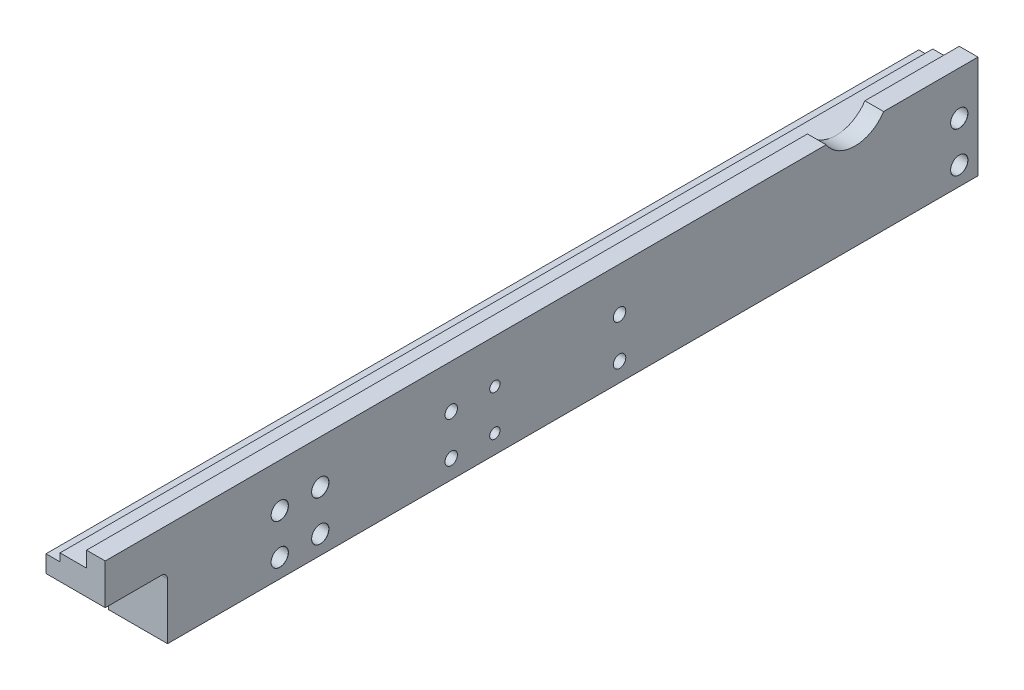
ISO-10303-21;
HEADER;
FILE_DESCRIPTION(('STEP AP214'),'2;1');
FILE_NAME('part.step','',(''),(''),'','','');
FILE_SCHEMA(('AUTOMOTIVE_DESIGN { 1 0 10303 214 1 1 1 1 }'));
ENDSEC;
DATA;
#1=APPLICATION_CONTEXT('core data for automotive mechanical design processes');
#2=APPLICATION_PROTOCOL_DEFINITION('international standard','automotive_design',2000,#1);
#3=PRODUCT_CONTEXT('',#1,'mechanical');
#4=PRODUCT('Part','Part','',(#3));
#5=PRODUCT_RELATED_PRODUCT_CATEGORY('part','',(#4));
#6=PRODUCT_DEFINITION_FORMATION('','',#4);
#7=PRODUCT_DEFINITION_CONTEXT('part definition',#1,'design');
#8=PRODUCT_DEFINITION('design','',#6,#7);
#9=PRODUCT_DEFINITION_SHAPE('','',#8);
#10=(LENGTH_UNIT() NAMED_UNIT(*) SI_UNIT(.MILLI.,.METRE.));
#11=(NAMED_UNIT(*) PLANE_ANGLE_UNIT() SI_UNIT($,.RADIAN.));
#12=(NAMED_UNIT(*) SI_UNIT($,.STERADIAN.) SOLID_ANGLE_UNIT());
#13=UNCERTAINTY_MEASURE_WITH_UNIT(LENGTH_MEASURE(1.E-05),#10,'distance_accuracy_value','');
#14=(GEOMETRIC_REPRESENTATION_CONTEXT(3) GLOBAL_UNCERTAINTY_ASSIGNED_CONTEXT((#13)) GLOBAL_UNIT_ASSIGNED_CONTEXT((#10,
#11,#12)) REPRESENTATION_CONTEXT('',''));
#15=CARTESIAN_POINT('',(0.,0.,0.));
#16=DIRECTION('',(0.,0.,1.));
#17=DIRECTION('',(1.,0.,0.));
#18=AXIS2_PLACEMENT_3D('',#15,#16,#17);
#19=CARTESIAN_POINT('',(-167.,218.05458814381,280.));
#20=DIRECTION('',(1.,0.,0.));
#21=DIRECTION('',(0.,0.,-1.));
#22=AXIS2_PLACEMENT_3D('',#19,#20,#21);
#23=PLANE('',#22);
#24=CARTESIAN_POINT('',(-167.,224.05458814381,169.));
#25=DIRECTION('',(-1.,0.,0.));
#26=DIRECTION('',(0.,0.,1.));
#27=AXIS2_PLACEMENT_3D('',#24,#25,#26);
#28=CIRCLE('',#27,2.);
#29=CARTESIAN_POINT('',(-167.,224.05458814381,171.));
#30=VERTEX_POINT('',#29);
#31=EDGE_CURVE('E139',#30,#30,#28,.T.);
#32=ORIENTED_EDGE('',*,*,#31,.F.);
#33=EDGE_LOOP('',(#32));
#34=FACE_BOUND('',#33,.T.);
#35=CARTESIAN_POINT('',(-167.,237.05458814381,169.));
#36=DIRECTION('',(-1.,0.,0.));
#37=DIRECTION('',(0.,0.,1.));
#38=AXIS2_PLACEMENT_3D('',#35,#36,#37);
#39=CIRCLE('',#38,2.);
#40=CARTESIAN_POINT('',(-167.,237.05458814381,171.));
#41=VERTEX_POINT('',#40);
#42=EDGE_CURVE('E145',#41,#41,#39,.T.);
#43=ORIENTED_EDGE('',*,*,#42,.F.);
#44=EDGE_LOOP('',(#43));
#45=FACE_BOUND('',#44,.T.);
#46=CARTESIAN_POINT('',(-167.,224.05458814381,115.));
#47=DIRECTION('',(-1.,0.,0.));
#48=DIRECTION('',(0.,0.,1.));
#49=AXIS2_PLACEMENT_3D('',#46,#47,#48);
#50=CIRCLE('',#49,2.);
#51=CARTESIAN_POINT('',(-167.,224.05458814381,117.));
#52=VERTEX_POINT('',#51);
#53=EDGE_CURVE('E151',#52,#52,#50,.T.);
#54=ORIENTED_EDGE('',*,*,#53,.F.);
#55=EDGE_LOOP('',(#54));
#56=FACE_BOUND('',#55,.T.);
#57=CARTESIAN_POINT('',(-167.,237.05458814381,155.));
#58=DIRECTION('',(-1.,0.,0.));
#59=DIRECTION('',(0.,0.,1.));
#60=AXIS2_PLACEMENT_3D('',#57,#58,#59);
#61=CIRCLE('',#60,1.65);
#62=CARTESIAN_POINT('',(-167.,237.05458814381,156.65));
#63=VERTEX_POINT('',#62);
#64=EDGE_CURVE('E163',#63,#63,#61,.T.);
#65=ORIENTED_EDGE('',*,*,#64,.F.);
#66=EDGE_LOOP('',(#65));
#67=FACE_BOUND('',#66,.T.);
#68=CARTESIAN_POINT('',(-167.,224.05458814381,155.));
#69=DIRECTION('',(-1.,0.,0.));
#70=DIRECTION('',(0.,0.,1.));
#71=AXIS2_PLACEMENT_3D('',#68,#69,#70);
#72=CIRCLE('',#71,1.65);
#73=CARTESIAN_POINT('',(-167.,224.05458814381,156.65));
#74=VERTEX_POINT('',#73);
#75=EDGE_CURVE('E169',#74,#74,#72,.T.);
#76=ORIENTED_EDGE('',*,*,#75,.F.);
#77=EDGE_LOOP('',(#76));
#78=FACE_BOUND('',#77,.T.);
#79=CARTESIAN_POINT('',(-167.,224.05458814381,224.));
#80=DIRECTION('',(-1.,0.,0.));
#81=DIRECTION('',(0.,0.,1.));
#82=AXIS2_PLACEMENT_3D('',#79,#80,#81);
#83=CIRCLE('',#82,5.025);
#84=CARTESIAN_POINT('',(-167.,224.05458814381,229.025));
#85=VERTEX_POINT('',#84);
#86=EDGE_CURVE('E178',#85,#85,#83,.T.);
#87=ORIENTED_EDGE('',*,*,#86,.F.);
#88=EDGE_LOOP('',(#87));
#89=FACE_BOUND('',#88,.T.);
#90=CARTESIAN_POINT('',(-167.,237.05458814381,224.));
#91=DIRECTION('',(-1.,0.,0.));
#92=DIRECTION('',(0.,0.,1.));
#93=AXIS2_PLACEMENT_3D('',#90,#91,#92);
#94=CIRCLE('',#93,5.025);
#95=CARTESIAN_POINT('',(-167.,237.05458814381,229.025));
#96=VERTEX_POINT('',#95);
#97=EDGE_CURVE('E199',#96,#96,#94,.T.);
#98=ORIENTED_EDGE('',*,*,#97,.F.);
#99=EDGE_LOOP('',(#98));
#100=FACE_BOUND('',#99,.T.);
#101=CARTESIAN_POINT('',(-167.,237.05458814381,211.));
#102=DIRECTION('',(-1.,0.,0.));
#103=DIRECTION('',(0.,0.,1.));
#104=AXIS2_PLACEMENT_3D('',#101,#102,#103);
#105=CIRCLE('',#104,5.025);
#106=CARTESIAN_POINT('',(-167.,237.05458814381,216.025));
#107=VERTEX_POINT('',#106);
#108=EDGE_CURVE('E220',#107,#107,#105,.T.);
#109=ORIENTED_EDGE('',*,*,#108,.F.);
#110=EDGE_LOOP('',(#109));
#111=FACE_BOUND('',#110,.T.);
#112=CARTESIAN_POINT('',(-167.,224.05458814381,211.));
#113=DIRECTION('',(-1.,0.,0.));
#114=DIRECTION('',(0.,0.,1.));
#115=AXIS2_PLACEMENT_3D('',#112,#113,#114);
#116=CIRCLE('',#115,5.025);
#117=CARTESIAN_POINT('',(-167.,224.05458814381,216.025));
#118=VERTEX_POINT('',#117);
#119=EDGE_CURVE('E241',#118,#118,#116,.T.);
#120=ORIENTED_EDGE('',*,*,#119,.F.);
#121=EDGE_LOOP('',(#120));
#122=FACE_BOUND('',#121,.T.);
#123=CARTESIAN_POINT('',(-167.,237.05458814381,6.));
#124=DIRECTION('',(-1.,0.,0.));
#125=DIRECTION('',(0.,0.,1.));
#126=AXIS2_PLACEMENT_3D('',#123,#124,#125);
#127=CIRCLE('',#126,5.025);
#128=CARTESIAN_POINT('',(-167.,237.05458814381,11.025));
#129=VERTEX_POINT('',#128);
#130=EDGE_CURVE('E262',#129,#129,#127,.T.);
#131=ORIENTED_EDGE('',*,*,#130,.F.);
#132=EDGE_LOOP('',(#131));
#133=FACE_BOUND('',#132,.T.);
#134=CARTESIAN_POINT('',(-167.,224.05458814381,6.));
#135=DIRECTION('',(-1.,0.,0.));
#136=DIRECTION('',(0.,0.,1.));
#137=AXIS2_PLACEMENT_3D('',#134,#135,#136);
#138=CIRCLE('',#137,5.025);
#139=CARTESIAN_POINT('',(-167.,224.05458814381,11.025));
#140=VERTEX_POINT('',#139);
#141=EDGE_CURVE('E283',#140,#140,#138,.T.);
#142=ORIENTED_EDGE('',*,*,#141,.F.);
#143=EDGE_LOOP('',(#142));
#144=FACE_BOUND('',#143,.T.);
#145=DIRECTION('',(0.,0.,-1.));
#146=VECTOR('',#145,1.);
#147=CARTESIAN_POINT('',(-167.,218.05458814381,280.));
#148=LINE('',#147,#146);
#149=CARTESIAN_POINT('',(-167.,218.05458814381,260.));
#150=VERTEX_POINT('',#149);
#151=CARTESIAN_POINT('',(-167.,218.05458814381,0.));
#152=VERTEX_POINT('',#151);
#153=EDGE_CURVE('E374',#150,#152,#148,.T.);
#154=ORIENTED_EDGE('',*,*,#153,.F.);
#155=DIRECTION('',(0.,-1.,0.));
#156=VECTOR('',#155,1.);
#157=CARTESIAN_POINT('',(-167.,218.05458814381,260.));
#158=LINE('',#157,#156);
#159=CARTESIAN_POINT('',(-167.,236.05458814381,260.));
#160=VERTEX_POINT('',#159);
#161=EDGE_CURVE('E335',#160,#150,#158,.T.);
#162=ORIENTED_EDGE('',*,*,#161,.F.);
#163=CARTESIAN_POINT('',(-167.,236.05458814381,262.));
#164=DIRECTION('',(1.,0.,0.));
#165=DIRECTION('',(0.,0.,-1.));
#166=AXIS2_PLACEMENT_3D('',#163,#164,#165);
#167=CIRCLE('',#166,2.);
#168=CARTESIAN_POINT('',(-167.,238.05458814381,262.));
#169=VERTEX_POINT('',#168);
#170=EDGE_CURVE('E24',#160,#169,#167,.T.);
#171=ORIENTED_EDGE('',*,*,#170,.T.);
#172=DIRECTION('',(0.,0.,-1.));
#173=VECTOR('',#172,1.);
#174=CARTESIAN_POINT('',(-167.,238.05458814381,280.));
#175=LINE('',#174,#173);
#176=CARTESIAN_POINT('',(-167.,238.05458814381,280.));
#177=VERTEX_POINT('',#176);
#178=EDGE_CURVE('E325',#177,#169,#175,.T.);
#179=ORIENTED_EDGE('',*,*,#178,.F.);
#180=DIRECTION('',(0.,-1.,0.));
#181=VECTOR('',#180,1.);
#182=CARTESIAN_POINT('',(-167.,218.05458814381,280.));
#183=LINE('',#182,#181);
#184=CARTESIAN_POINT('',(-167.,243.55458814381,280.));
#185=VERTEX_POINT('',#184);
#186=EDGE_CURVE('E355',#185,#177,#183,.T.);
#187=ORIENTED_EDGE('',*,*,#186,.F.);
#188=DIRECTION('',(0.,0.,-1.));
#189=VECTOR('',#188,1.);
#190=CARTESIAN_POINT('',(-167.,243.55458814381,280.));
#191=LINE('',#190,#189);
#192=CARTESIAN_POINT('',(-167.,243.55458814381,0.));
#193=VERTEX_POINT('',#192);
#194=EDGE_CURVE('E376',#185,#193,#191,.T.);
#195=ORIENTED_EDGE('',*,*,#194,.T.);
#196=DIRECTION('',(0.,-1.,0.));
#197=VECTOR('',#196,1.);
#198=CARTESIAN_POINT('',(-167.,218.05458814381,0.));
#199=LINE('',#198,#197);
#200=EDGE_CURVE('E368',#193,#152,#199,.T.);
#201=ORIENTED_EDGE('',*,*,#200,.T.);
#202=EDGE_LOOP('',(#154,#162,#171,#179,#187,#195,#201));
#203=FACE_BOUND('',#202,.T.);
#204=CARTESIAN_POINT('',(-167.,237.05458814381,115.));
#205=DIRECTION('',(-1.,0.,0.));
#206=DIRECTION('',(0.,0.,1.));
#207=AXIS2_PLACEMENT_3D('',#204,#205,#206);
#208=CIRCLE('',#207,2.);
#209=CARTESIAN_POINT('',(-167.,237.05458814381,117.));
#210=VERTEX_POINT('',#209);
#211=EDGE_CURVE('E157',#210,#210,#208,.T.);
#212=ORIENTED_EDGE('',*,*,#211,.F.);
#213=EDGE_LOOP('',(#212));
#214=FACE_BOUND('',#213,.T.);
#215=ADVANCED_FACE('F16',(#34,#45,#56,#67,#78,#89,#100,#111,#122,#133,#144,#203,#214),#23,.F.);
#216=CARTESIAN_POINT('',(-148.,251.054588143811,280.));
#217=DIRECTION('',(0.,-1.,0.));
#218=DIRECTION('',(0.,0.,-1.));
#219=AXIS2_PLACEMENT_3D('',#216,#217,#218);
#220=PLANE('',#219);
#221=DIRECTION('',(0.,0.,-1.));
#222=VECTOR('',#221,1.);
#223=CARTESIAN_POINT('',(-154.,251.054588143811,280.));
#224=LINE('',#223,#222);
#225=CARTESIAN_POINT('',(-154.,251.054588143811,30.2804555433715));
#226=VERTEX_POINT('',#225);
#227=CARTESIAN_POINT('',(-154.,251.054588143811,0.));
#228=VERTEX_POINT('',#227);
#229=EDGE_CURVE('E379',#226,#228,#224,.T.);
#230=ORIENTED_EDGE('',*,*,#229,.F.);
#231=DIRECTION('',(1.,0.,0.));
#232=VECTOR('',#231,1.);
#233=CARTESIAN_POINT('',(-167.,251.054588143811,30.2804555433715));
#234=LINE('',#233,#232);
#235=CARTESIAN_POINT('',(-148.,251.054588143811,30.2804555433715));
#236=VERTEX_POINT('',#235);
#237=EDGE_CURVE('E31',#226,#236,#234,.T.);
#238=ORIENTED_EDGE('',*,*,#237,.T.);
#239=DIRECTION('',(0.,0.,-1.));
#240=VECTOR('',#239,1.);
#241=CARTESIAN_POINT('',(-148.,251.054588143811,280.));
#242=LINE('',#241,#240);
#243=CARTESIAN_POINT('',(-148.,251.054588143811,0.));
#244=VERTEX_POINT('',#243);
#245=EDGE_CURVE('E383',#236,#244,#242,.T.);
#246=ORIENTED_EDGE('',*,*,#245,.T.);
#247=DIRECTION('',(-1.,0.,0.));
#248=VECTOR('',#247,1.);
#249=CARTESIAN_POINT('',(-148.,251.054588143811,0.));
#250=LINE('',#249,#248);
#251=EDGE_CURVE('E361',#244,#228,#250,.T.);
#252=ORIENTED_EDGE('',*,*,#251,.T.);
#253=EDGE_LOOP('',(#230,#238,#246,#252));
#254=FACE_BOUND('',#253,.T.);
#255=ADVANCED_FACE('F426',(#254),#220,.F.);
#256=CARTESIAN_POINT('',(-154.,251.054588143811,280.));
#257=DIRECTION('',(1.,0.,0.));
#258=DIRECTION('',(0.,0.,-1.));
#259=AXIS2_PLACEMENT_3D('',#256,#257,#258);
#260=PLANE('',#259);
#261=CARTESIAN_POINT('',(-154.,251.054588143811,280.));
#262=VERTEX_POINT('',#261);
#263=CARTESIAN_POINT('',(-154.,251.054588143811,48.7195444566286));
#264=VERTEX_POINT('',#263);
#265=EDGE_CURVE('E380',#262,#264,#224,.T.);
#266=ORIENTED_EDGE('',*,*,#265,.T.);
#267=CARTESIAN_POINT('',(-154.,257.054588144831,39.5));
#268=DIRECTION('',(1.,0.,0.));
#269=DIRECTION('',(0.,0.,-1.));
#270=AXIS2_PLACEMENT_3D('',#267,#268,#269);
#271=CIRCLE('',#270,11.);
#272=CARTESIAN_POINT('',(-154.,246.054588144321,39.5));
#273=VERTEX_POINT('',#272);
#274=EDGE_CURVE('E305',#264,#273,#271,.T.);
#275=ORIENTED_EDGE('',*,*,#274,.T.);
#276=DIRECTION('',(0.,0.,1.));
#277=VECTOR('',#276,1.);
#278=CARTESIAN_POINT('',(-154.,246.05458814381,0.));
#279=LINE('',#278,#277);
#280=CARTESIAN_POINT('',(-154.,246.05458814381,280.));
#281=VERTEX_POINT('',#280);
#282=EDGE_CURVE('E318',#273,#281,#279,.T.);
#283=ORIENTED_EDGE('',*,*,#282,.T.);
#284=DIRECTION('',(0.,-1.,0.));
#285=VECTOR('',#284,1.);
#286=CARTESIAN_POINT('',(-154.,251.054588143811,280.));
#287=LINE('',#286,#285);
#288=EDGE_CURVE('E351',#262,#281,#287,.T.);
#289=ORIENTED_EDGE('',*,*,#288,.F.);
#290=EDGE_LOOP('',(#266,#275,#283,#289));
#291=FACE_BOUND('',#290,.T.);
#292=ADVANCED_FACE('F434',(#291),#260,.F.);
#293=CARTESIAN_POINT('',(-148.,218.05458814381,280.));
#294=DIRECTION('',(-1.,0.,0.));
#295=DIRECTION('',(0.,0.,1.));
#296=AXIS2_PLACEMENT_3D('',#293,#294,#295);
#297=PLANE('',#296);
#298=CARTESIAN_POINT('',(-148.,224.05458814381,169.));
#299=DIRECTION('',(-1.,0.,0.));
#300=DIRECTION('',(0.,0.,1.));
#301=AXIS2_PLACEMENT_3D('',#298,#299,#300);
#302=CIRCLE('',#301,2.);
#303=CARTESIAN_POINT('',(-148.,224.05458814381,171.));
#304=VERTEX_POINT('',#303);
#305=EDGE_CURVE('E142',#304,#304,#302,.T.);
#306=ORIENTED_EDGE('',*,*,#305,.T.);
#307=EDGE_LOOP('',(#306));
#308=FACE_BOUND('',#307,.T.);
#309=CARTESIAN_POINT('',(-148.,237.05458814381,169.));
#310=DIRECTION('',(-1.,0.,0.));
#311=DIRECTION('',(0.,0.,1.));
#312=AXIS2_PLACEMENT_3D('',#309,#310,#311);
#313=CIRCLE('',#312,2.);
#314=CARTESIAN_POINT('',(-148.,237.05458814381,171.));
#315=VERTEX_POINT('',#314);
#316=EDGE_CURVE('E148',#315,#315,#313,.T.);
#317=ORIENTED_EDGE('',*,*,#316,.T.);
#318=EDGE_LOOP('',(#317));
#319=FACE_BOUND('',#318,.T.);
#320=CARTESIAN_POINT('',(-148.,224.05458814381,115.));
#321=DIRECTION('',(-1.,0.,0.));
#322=DIRECTION('',(0.,0.,1.));
#323=AXIS2_PLACEMENT_3D('',#320,#321,#322);
#324=CIRCLE('',#323,2.);
#325=CARTESIAN_POINT('',(-148.,224.05458814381,117.));
#326=VERTEX_POINT('',#325);
#327=EDGE_CURVE('E154',#326,#326,#324,.T.);
#328=ORIENTED_EDGE('',*,*,#327,.T.);
#329=EDGE_LOOP('',(#328));
#330=FACE_BOUND('',#329,.T.);
#331=CARTESIAN_POINT('',(-148.,237.05458814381,115.));
#332=DIRECTION('',(-1.,0.,0.));
#333=DIRECTION('',(0.,0.,1.));
#334=AXIS2_PLACEMENT_3D('',#331,#332,#333);
#335=CIRCLE('',#334,2.);
#336=CARTESIAN_POINT('',(-148.,237.05458814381,117.));
#337=VERTEX_POINT('',#336);
#338=EDGE_CURVE('E160',#337,#337,#335,.T.);
#339=ORIENTED_EDGE('',*,*,#338,.T.);
#340=EDGE_LOOP('',(#339));
#341=FACE_BOUND('',#340,.T.);
#342=CARTESIAN_POINT('',(-148.,237.05458814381,155.));
#343=DIRECTION('',(-1.,0.,0.));
#344=DIRECTION('',(0.,0.,1.));
#345=AXIS2_PLACEMENT_3D('',#342,#343,#344);
#346=CIRCLE('',#345,1.65);
#347=CARTESIAN_POINT('',(-148.,237.05458814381,156.65));
#348=VERTEX_POINT('',#347);
#349=EDGE_CURVE('E166',#348,#348,#346,.T.);
#350=ORIENTED_EDGE('',*,*,#349,.T.);
#351=EDGE_LOOP('',(#350));
#352=FACE_BOUND('',#351,.T.);
#353=CARTESIAN_POINT('',(-148.,224.05458814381,155.));
#354=DIRECTION('',(-1.,0.,0.));
#355=DIRECTION('',(0.,0.,1.));
#356=AXIS2_PLACEMENT_3D('',#353,#354,#355);
#357=CIRCLE('',#356,1.65);
#358=CARTESIAN_POINT('',(-148.,224.05458814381,156.65));
#359=VERTEX_POINT('',#358);
#360=EDGE_CURVE('E172',#359,#359,#357,.T.);
#361=ORIENTED_EDGE('',*,*,#360,.T.);
#362=EDGE_LOOP('',(#361));
#363=FACE_BOUND('',#362,.T.);
#364=CARTESIAN_POINT('',(-148.,224.05458814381,224.));
#365=DIRECTION('',(-1.,0.,0.));
#366=DIRECTION('',(0.,0.,1.));
#367=AXIS2_PLACEMENT_3D('',#364,#365,#366);
#368=CIRCLE('',#367,2.775);
#369=CARTESIAN_POINT('',(-148.,224.05458814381,226.775));
#370=VERTEX_POINT('',#369);
#371=EDGE_CURVE('E175',#370,#370,#368,.T.);
#372=ORIENTED_EDGE('',*,*,#371,.T.);
#373=EDGE_LOOP('',(#372));
#374=FACE_BOUND('',#373,.T.);
#375=CARTESIAN_POINT('',(-148.,237.05458814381,224.));
#376=DIRECTION('',(-1.,0.,0.));
#377=DIRECTION('',(0.,0.,1.));
#378=AXIS2_PLACEMENT_3D('',#375,#376,#377);
#379=CIRCLE('',#378,2.775);
#380=CARTESIAN_POINT('',(-148.,237.05458814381,226.775));
#381=VERTEX_POINT('',#380);
#382=EDGE_CURVE('E196',#381,#381,#379,.T.);
#383=ORIENTED_EDGE('',*,*,#382,.T.);
#384=EDGE_LOOP('',(#383));
#385=FACE_BOUND('',#384,.T.);
#386=CARTESIAN_POINT('',(-148.,237.05458814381,211.));
#387=DIRECTION('',(-1.,0.,0.));
#388=DIRECTION('',(0.,0.,1.));
#389=AXIS2_PLACEMENT_3D('',#386,#387,#388);
#390=CIRCLE('',#389,2.775);
#391=CARTESIAN_POINT('',(-148.,237.05458814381,213.775));
#392=VERTEX_POINT('',#391);
#393=EDGE_CURVE('E217',#392,#392,#390,.T.);
#394=ORIENTED_EDGE('',*,*,#393,.T.);
#395=EDGE_LOOP('',(#394));
#396=FACE_BOUND('',#395,.T.);
#397=CARTESIAN_POINT('',(-148.,224.05458814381,211.));
#398=DIRECTION('',(-1.,0.,0.));
#399=DIRECTION('',(0.,0.,1.));
#400=AXIS2_PLACEMENT_3D('',#397,#398,#399);
#401=CIRCLE('',#400,2.775);
#402=CARTESIAN_POINT('',(-148.,224.05458814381,213.775));
#403=VERTEX_POINT('',#402);
#404=EDGE_CURVE('E238',#403,#403,#401,.T.);
#405=ORIENTED_EDGE('',*,*,#404,.T.);
#406=EDGE_LOOP('',(#405));
#407=FACE_BOUND('',#406,.T.);
#408=CARTESIAN_POINT('',(-148.,237.05458814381,6.));
#409=DIRECTION('',(-1.,0.,0.));
#410=DIRECTION('',(0.,0.,1.));
#411=AXIS2_PLACEMENT_3D('',#408,#409,#410);
#412=CIRCLE('',#411,2.775);
#413=CARTESIAN_POINT('',(-148.,237.05458814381,8.775));
#414=VERTEX_POINT('',#413);
#415=EDGE_CURVE('E259',#414,#414,#412,.T.);
#416=ORIENTED_EDGE('',*,*,#415,.T.);
#417=EDGE_LOOP('',(#416));
#418=FACE_BOUND('',#417,.T.);
#419=CARTESIAN_POINT('',(-148.,224.05458814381,6.));
#420=DIRECTION('',(-1.,0.,0.));
#421=DIRECTION('',(0.,0.,1.));
#422=AXIS2_PLACEMENT_3D('',#419,#420,#421);
#423=CIRCLE('',#422,2.775);
#424=CARTESIAN_POINT('',(-148.,224.05458814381,8.775));
#425=VERTEX_POINT('',#424);
#426=EDGE_CURVE('E280',#425,#425,#423,.T.);
#427=ORIENTED_EDGE('',*,*,#426,.T.);
#428=EDGE_LOOP('',(#427));
#429=FACE_BOUND('',#428,.T.);
#430=ORIENTED_EDGE('',*,*,#245,.F.);
#431=CARTESIAN_POINT('',(-148.,257.054588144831,39.5));
#432=DIRECTION('',(1.,0.,0.));
#433=DIRECTION('',(0.,0.,-1.));
#434=AXIS2_PLACEMENT_3D('',#431,#432,#433);
#435=CIRCLE('',#434,11.);
#436=CARTESIAN_POINT('',(-148.,251.054588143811,48.7195444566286));
#437=VERTEX_POINT('',#436);
#438=EDGE_CURVE('E301',#437,#236,#435,.T.);
#439=ORIENTED_EDGE('',*,*,#438,.F.);
#440=CARTESIAN_POINT('',(-148.,251.054588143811,280.));
#441=VERTEX_POINT('',#440);
#442=EDGE_CURVE('E384',#441,#437,#242,.T.);
#443=ORIENTED_EDGE('',*,*,#442,.F.);
#444=DIRECTION('',(0.,1.,0.));
#445=VECTOR('',#444,1.);
#446=CARTESIAN_POINT('',(-148.,218.05458814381,280.));
#447=LINE('',#446,#445);
#448=CARTESIAN_POINT('',(-148.,238.05458814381,280.));
#449=VERTEX_POINT('',#448);
#450=EDGE_CURVE('E346',#449,#441,#447,.T.);
#451=ORIENTED_EDGE('',*,*,#450,.F.);
#452=DIRECTION('',(0.,0.,-1.));
#453=VECTOR('',#452,1.);
#454=CARTESIAN_POINT('',(-148.,238.05458814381,280.));
#455=LINE('',#454,#453);
#456=CARTESIAN_POINT('',(-148.,238.05458814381,262.));
#457=VERTEX_POINT('',#456);
#458=EDGE_CURVE('E331',#449,#457,#455,.T.);
#459=ORIENTED_EDGE('',*,*,#458,.T.);
#460=CARTESIAN_POINT('',(-148.,236.05458814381,262.));
#461=DIRECTION('',(-1.,0.,0.));
#462=DIRECTION('',(0.,0.,1.));
#463=AXIS2_PLACEMENT_3D('',#460,#461,#462);
#464=CIRCLE('',#463,2.);
#465=CARTESIAN_POINT('',(-148.,236.05458814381,260.));
#466=VERTEX_POINT('',#465);
#467=EDGE_CURVE('E11',#457,#466,#464,.T.);
#468=ORIENTED_EDGE('',*,*,#467,.T.);
#469=DIRECTION('',(0.,-1.,0.));
#470=VECTOR('',#469,1.);
#471=CARTESIAN_POINT('',(-148.,218.05458814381,260.));
#472=LINE('',#471,#470);
#473=CARTESIAN_POINT('',(-148.,218.05458814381,260.));
#474=VERTEX_POINT('',#473);
#475=EDGE_CURVE('E334',#466,#474,#472,.T.);
#476=ORIENTED_EDGE('',*,*,#475,.T.);
#477=DIRECTION('',(0.,0.,-1.));
#478=VECTOR('',#477,1.);
#479=CARTESIAN_POINT('',(-148.,218.05458814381,280.));
#480=LINE('',#479,#478);
#481=CARTESIAN_POINT('',(-148.,218.05458814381,0.));
#482=VERTEX_POINT('',#481);
#483=EDGE_CURVE('E358',#474,#482,#480,.T.);
#484=ORIENTED_EDGE('',*,*,#483,.T.);
#485=DIRECTION('',(0.,1.,0.));
#486=VECTOR('',#485,1.);
#487=CARTESIAN_POINT('',(-148.,218.05458814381,0.));
#488=LINE('',#487,#486);
#489=EDGE_CURVE('E344',#482,#244,#488,.T.);
#490=ORIENTED_EDGE('',*,*,#489,.T.);
#491=EDGE_LOOP('',(#430,#439,#443,#451,#459,#468,#476,#484,#490));
#492=FACE_BOUND('',#491,.T.);
#493=ADVANCED_FACE('F407',(#308,#319,#330,#341,#352,#363,#374,#385,#396,#407,#418,#429,#492),
#297,.F.);
#494=ORIENTED_EDGE('',*,*,#442,.T.);
#495=DIRECTION('',(1.,0.,0.));
#496=VECTOR('',#495,1.);
#497=CARTESIAN_POINT('',(-167.,251.054588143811,48.7195444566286));
#498=LINE('',#497,#496);
#499=EDGE_CURVE('E307',#437,#264,#498,.F.);
#500=ORIENTED_EDGE('',*,*,#499,.T.);
#501=ORIENTED_EDGE('',*,*,#265,.F.);
#502=DIRECTION('',(-1.,0.,0.));
#503=VECTOR('',#502,1.);
#504=CARTESIAN_POINT('',(-148.,251.054588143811,280.));
#505=LINE('',#504,#503);
#506=EDGE_CURVE('E348',#441,#262,#505,.T.);
#507=ORIENTED_EDGE('',*,*,#506,.F.);
#508=EDGE_LOOP('',(#494,#500,#501,#507));
#509=FACE_BOUND('',#508,.T.);
#510=ADVANCED_FACE('F446',(#509),#220,.F.);
#511=CARTESIAN_POINT('',(-154.,246.05458814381,0.));
#512=VERTEX_POINT('',#511);
#513=EDGE_CURVE('E328',#512,#273,#279,.T.);
#514=ORIENTED_EDGE('',*,*,#513,.T.);
#515=EDGE_CURVE('E303',#273,#226,#271,.T.);
#516=ORIENTED_EDGE('',*,*,#515,.T.);
#517=ORIENTED_EDGE('',*,*,#229,.T.);
#518=DIRECTION('',(0.,-1.,0.));
#519=VECTOR('',#518,1.);
#520=CARTESIAN_POINT('',(-154.,251.054588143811,0.));
#521=LINE('',#520,#519);
#522=EDGE_CURVE('E364',#228,#512,#521,.T.);
#523=ORIENTED_EDGE('',*,*,#522,.T.);
#524=EDGE_LOOP('',(#514,#516,#517,#523));
#525=FACE_BOUND('',#524,.T.);
#526=ADVANCED_FACE('F428',(#525),#260,.F.);
#527=CARTESIAN_POINT('',(-167.,243.55458814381,280.));
#528=DIRECTION('',(0.,-1.,0.));
#529=DIRECTION('',(0.,0.,-1.));
#530=AXIS2_PLACEMENT_3D('',#527,#528,#529);
#531=PLANE('',#530);
#532=DIRECTION('',(-1.,0.,0.));
#533=VECTOR('',#532,1.);
#534=CARTESIAN_POINT('',(-167.,243.55458814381,280.));
#535=LINE('',#534,#533);
#536=CARTESIAN_POINT('',(-162.5,243.55458814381,280.));
#537=VERTEX_POINT('',#536);
#538=EDGE_CURVE('E39',#537,#185,#535,.T.);
#539=ORIENTED_EDGE('',*,*,#538,.F.);
#540=DIRECTION('',(0.,0.,1.));
#541=VECTOR('',#540,1.);
#542=CARTESIAN_POINT('',(-162.5,243.55458814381,0.));
#543=LINE('',#542,#541);
#544=CARTESIAN_POINT('',(-162.5,243.55458814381,0.));
#545=VERTEX_POINT('',#544);
#546=EDGE_CURVE('E323',#545,#537,#543,.T.);
#547=ORIENTED_EDGE('',*,*,#546,.F.);
#548=DIRECTION('',(-1.,0.,0.));
#549=VECTOR('',#548,1.);
#550=CARTESIAN_POINT('',(-167.,243.55458814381,0.));
#551=LINE('',#550,#549);
#552=EDGE_CURVE('E366',#545,#193,#551,.T.);
#553=ORIENTED_EDGE('',*,*,#552,.T.);
#554=ORIENTED_EDGE('',*,*,#194,.F.);
#555=EDGE_LOOP('',(#539,#547,#553,#554));
#556=FACE_BOUND('',#555,.T.);
#557=ADVANCED_FACE('F455',(#556),#531,.F.);
#558=CARTESIAN_POINT('',(-148.,218.05458814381,280.));
#559=DIRECTION('',(0.,1.,0.));
#560=DIRECTION('',(0.,0.,1.));
#561=AXIS2_PLACEMENT_3D('',#558,#559,#560);
#562=PLANE('',#561);
#563=CARTESIAN_POINT('',(-157.500000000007,218.05458814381,53.5));
#564=DIRECTION('',(0.,-1.,0.));
#565=DIRECTION('',(0.,0.,-1.));
#566=AXIS2_PLACEMENT_3D('',#563,#564,#565);
#567=CIRCLE('',#566,1.65);
#568=CARTESIAN_POINT('',(-157.500000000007,218.05458814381,51.85));
#569=VERTEX_POINT('',#568);
#570=EDGE_CURVE('E129',#569,#569,#567,.T.);
#571=ORIENTED_EDGE('',*,*,#570,.F.);
#572=EDGE_LOOP('',(#571));
#573=FACE_BOUND('',#572,.T.);
#574=CARTESIAN_POINT('',(-157.500000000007,218.05458814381,25.5));
#575=DIRECTION('',(0.,-1.,0.));
#576=DIRECTION('',(0.,0.,-1.));
#577=AXIS2_PLACEMENT_3D('',#574,#575,#576);
#578=CIRCLE('',#577,1.65);
#579=CARTESIAN_POINT('',(-157.500000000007,218.05458814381,23.85));
#580=VERTEX_POINT('',#579);
#581=EDGE_CURVE('E128',#580,#580,#578,.T.);
#582=ORIENTED_EDGE('',*,*,#581,.F.);
#583=EDGE_LOOP('',(#582));
#584=FACE_BOUND('',#583,.T.);
#585=ORIENTED_EDGE('',*,*,#483,.F.);
#586=DIRECTION('',(-1.,0.,0.));
#587=VECTOR('',#586,1.);
#588=CARTESIAN_POINT('',(-148.,218.05458814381,260.));
#589=LINE('',#588,#587);
#590=EDGE_CURVE('E341',#474,#150,#589,.T.);
#591=ORIENTED_EDGE('',*,*,#590,.T.);
#592=ORIENTED_EDGE('',*,*,#153,.T.);
#593=DIRECTION('',(1.,0.,0.));
#594=VECTOR('',#593,1.);
#595=CARTESIAN_POINT('',(-148.,218.05458814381,0.));
#596=LINE('',#595,#594);
#597=EDGE_CURVE('E349',#152,#482,#596,.T.);
#598=ORIENTED_EDGE('',*,*,#597,.T.);
#599=EDGE_LOOP('',(#585,#591,#592,#598));
#600=FACE_BOUND('',#599,.T.);
#601=ADVANCED_FACE('F414',(#573,#584,#600),#562,.F.);
#602=CARTESIAN_POINT('',(0.,0.,280.));
#603=DIRECTION('',(0.,0.,1.));
#604=DIRECTION('',(1.,0.,0.));
#605=AXIS2_PLACEMENT_3D('',#602,#603,#604);
#606=PLANE('',#605);
#607=ORIENTED_EDGE('',*,*,#288,.T.);
#608=DIRECTION('',(-1.,0.,0.));
#609=VECTOR('',#608,1.);
#610=CARTESIAN_POINT('',(-154.,246.05458814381,280.));
#611=LINE('',#610,#609);
#612=CARTESIAN_POINT('',(-162.5,246.05458814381,280.));
#613=VERTEX_POINT('',#612);
#614=EDGE_CURVE('E310',#281,#613,#611,.T.);
#615=ORIENTED_EDGE('',*,*,#614,.T.);
#616=DIRECTION('',(0.,-1.,0.));
#617=VECTOR('',#616,1.);
#618=CARTESIAN_POINT('',(-162.5,243.55458814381,280.));
#619=LINE('',#618,#617);
#620=EDGE_CURVE('E315',#613,#537,#619,.T.);
#621=ORIENTED_EDGE('',*,*,#620,.T.);
#622=ORIENTED_EDGE('',*,*,#538,.T.);
#623=ORIENTED_EDGE('',*,*,#186,.T.);
#624=DIRECTION('',(-1.,0.,0.));
#625=VECTOR('',#624,1.);
#626=CARTESIAN_POINT('',(-148.,238.05458814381,280.));
#627=LINE('',#626,#625);
#628=EDGE_CURVE('E337',#449,#177,#627,.T.);
#629=ORIENTED_EDGE('',*,*,#628,.F.);
#630=ORIENTED_EDGE('',*,*,#450,.T.);
#631=ORIENTED_EDGE('',*,*,#506,.T.);
#632=EDGE_LOOP('',(#607,#615,#621,#622,#623,#629,#630,#631));
#633=FACE_BOUND('',#632,.T.);
#634=ADVANCED_FACE('F442',(#633),#606,.T.);
#635=CARTESIAN_POINT('',(0.,0.,0.));
#636=DIRECTION('',(0.,0.,1.));
#637=DIRECTION('',(1.,0.,0.));
#638=AXIS2_PLACEMENT_3D('',#635,#636,#637);
#639=PLANE('',#638);
#640=DIRECTION('',(-1.,0.,0.));
#641=VECTOR('',#640,1.);
#642=CARTESIAN_POINT('',(-154.,246.05458814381,0.));
#643=LINE('',#642,#641);
#644=CARTESIAN_POINT('',(-162.5,246.05458814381,0.));
#645=VERTEX_POINT('',#644);
#646=EDGE_CURVE('E311',#512,#645,#643,.T.);
#647=ORIENTED_EDGE('',*,*,#646,.F.);
#648=ORIENTED_EDGE('',*,*,#522,.F.);
#649=ORIENTED_EDGE('',*,*,#251,.F.);
#650=ORIENTED_EDGE('',*,*,#489,.F.);
#651=ORIENTED_EDGE('',*,*,#597,.F.);
#652=ORIENTED_EDGE('',*,*,#200,.F.);
#653=ORIENTED_EDGE('',*,*,#552,.F.);
#654=DIRECTION('',(0.,-1.,0.));
#655=VECTOR('',#654,1.);
#656=CARTESIAN_POINT('',(-162.5,243.55458814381,0.));
#657=LINE('',#656,#655);
#658=EDGE_CURVE('E314',#645,#545,#657,.T.);
#659=ORIENTED_EDGE('',*,*,#658,.F.);
#660=EDGE_LOOP('',(#647,#648,#649,#650,#651,#652,#653,#659));
#661=FACE_BOUND('',#660,.T.);
#662=ADVANCED_FACE('F421',(#661),#639,.F.);
#663=CARTESIAN_POINT('',(-148.,218.05458814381,260.));
#664=DIRECTION('',(0.,0.,-1.));
#665=DIRECTION('',(-1.,0.,0.));
#666=AXIS2_PLACEMENT_3D('',#663,#664,#665);
#667=PLANE('',#666);
#668=ORIENTED_EDGE('',*,*,#475,.F.);
#669=DIRECTION('',(-1.,0.,0.));
#670=VECTOR('',#669,1.);
#671=CARTESIAN_POINT('',(-167.,236.05458814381,260.));
#672=LINE('',#671,#670);
#673=EDGE_CURVE('E387',#466,#160,#672,.T.);
#674=ORIENTED_EDGE('',*,*,#673,.T.);
#675=ORIENTED_EDGE('',*,*,#161,.T.);
#676=ORIENTED_EDGE('',*,*,#590,.F.);
#677=EDGE_LOOP('',(#668,#674,#675,#676));
#678=FACE_BOUND('',#677,.T.);
#679=ADVANCED_FACE('F411',(#678),#667,.F.);
#680=CARTESIAN_POINT('',(-148.,238.05458814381,280.));
#681=DIRECTION('',(0.,1.,0.));
#682=DIRECTION('',(0.,0.,1.));
#683=AXIS2_PLACEMENT_3D('',#680,#681,#682);
#684=PLANE('',#683);
#685=ORIENTED_EDGE('',*,*,#178,.T.);
#686=DIRECTION('',(-1.,0.,0.));
#687=VECTOR('',#686,1.);
#688=CARTESIAN_POINT('',(-148.,238.05458814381,262.));
#689=LINE('',#688,#687);
#690=EDGE_CURVE('E390',#169,#457,#689,.F.);
#691=ORIENTED_EDGE('',*,*,#690,.T.);
#692=ORIENTED_EDGE('',*,*,#458,.F.);
#693=ORIENTED_EDGE('',*,*,#628,.T.);
#694=EDGE_LOOP('',(#685,#691,#692,#693));
#695=FACE_BOUND('',#694,.T.);
#696=ADVANCED_FACE('F401',(#695),#684,.F.);
#697=CARTESIAN_POINT('',(-148.,236.05458814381,262.));
#698=DIRECTION('',(1.,0.,0.));
#699=DIRECTION('',(0.,0.,-1.));
#700=AXIS2_PLACEMENT_3D('',#697,#698,#699);
#701=CYLINDRICAL_SURFACE('',#700,2.);
#702=ORIENTED_EDGE('',*,*,#467,.F.);
#703=ORIENTED_EDGE('',*,*,#690,.F.);
#704=ORIENTED_EDGE('',*,*,#170,.F.);
#705=ORIENTED_EDGE('',*,*,#673,.F.);
#706=EDGE_LOOP('',(#702,#703,#704,#705));
#707=FACE_BOUND('',#706,.T.);
#708=ADVANCED_FACE('F18',(#707),#701,.F.);
#709=CARTESIAN_POINT('',(-162.5,243.55458814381,0.));
#710=DIRECTION('',(-1.,0.,0.));
#711=DIRECTION('',(0.,0.,1.));
#712=AXIS2_PLACEMENT_3D('',#709,#710,#711);
#713=PLANE('',#712);
#714=ORIENTED_EDGE('',*,*,#620,.F.);
#715=DIRECTION('',(0.,0.,1.));
#716=VECTOR('',#715,1.);
#717=CARTESIAN_POINT('',(-162.5,246.05458814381,0.));
#718=LINE('',#717,#716);
#719=EDGE_CURVE('E326',#645,#613,#718,.T.);
#720=ORIENTED_EDGE('',*,*,#719,.F.);
#721=ORIENTED_EDGE('',*,*,#658,.T.);
#722=ORIENTED_EDGE('',*,*,#546,.T.);
#723=EDGE_LOOP('',(#714,#720,#721,#722));
#724=FACE_BOUND('',#723,.T.);
#725=ADVANCED_FACE('F668',(#724),#713,.T.);
#726=CARTESIAN_POINT('',(-154.,246.05458814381,0.));
#727=DIRECTION('',(0.,1.,0.));
#728=DIRECTION('',(0.,0.,1.));
#729=AXIS2_PLACEMENT_3D('',#726,#727,#728);
#730=PLANE('',#729);
#731=ORIENTED_EDGE('',*,*,#282,.F.);
#732=ORIENTED_EDGE('',*,*,#513,.F.);
#733=ORIENTED_EDGE('',*,*,#646,.T.);
#734=ORIENTED_EDGE('',*,*,#719,.T.);
#735=ORIENTED_EDGE('',*,*,#614,.F.);
#736=EDGE_LOOP('',(#731,#732,#733,#734,#735));
#737=FACE_BOUND('',#736,.T.);
#738=ADVANCED_FACE('F439',(#737),#730,.T.);
#739=CARTESIAN_POINT('',(-167.,257.054588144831,39.5));
#740=DIRECTION('',(1.,0.,0.));
#741=DIRECTION('',(0.,0.,-1.));
#742=AXIS2_PLACEMENT_3D('',#739,#740,#741);
#743=CYLINDRICAL_SURFACE('',#742,11.);
#744=ORIENTED_EDGE('',*,*,#438,.T.);
#745=ORIENTED_EDGE('',*,*,#237,.F.);
#746=ORIENTED_EDGE('',*,*,#515,.F.);
#747=ORIENTED_EDGE('',*,*,#274,.F.);
#748=ORIENTED_EDGE('',*,*,#499,.F.);
#749=EDGE_LOOP('',(#744,#745,#746,#747,#748));
#750=FACE_BOUND('',#749,.T.);
#751=ADVANCED_FACE('F431',(#750),#743,.F.);
#752=CARTESIAN_POINT('',(-148.025,224.05458814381,6.));
#753=DIRECTION('',(1.,0.,0.));
#754=DIRECTION('',(0.,0.,-1.));
#755=AXIS2_PLACEMENT_3D('',#752,#753,#754);
#756=CONICAL_SURFACE('',#755,2.75,0.785398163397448);
#757=ORIENTED_EDGE('',*,*,#426,.F.);
#758=EDGE_LOOP('',(#757));
#759=FACE_BOUND('',#758,.T.);
#760=CARTESIAN_POINT('',(-148.025,224.05458814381,6.));
#761=DIRECTION('',(-1.,0.,0.));
#762=DIRECTION('',(0.,0.,1.));
#763=AXIS2_PLACEMENT_3D('',#760,#761,#762);
#764=CIRCLE('',#763,2.75);
#765=CARTESIAN_POINT('',(-148.025,224.05458814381,8.75));
#766=VERTEX_POINT('',#765);
#767=EDGE_CURVE('E298',#766,#766,#764,.T.);
#768=ORIENTED_EDGE('',*,*,#767,.T.);
#769=EDGE_LOOP('',(#768));
#770=FACE_BOUND('',#769,.T.);
#771=ADVANCED_FACE('F661',(#759,#770),#756,.F.);
#772=CARTESIAN_POINT('',(-167.,224.05458814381,6.));
#773=DIRECTION('',(-1.,0.,0.));
#774=DIRECTION('',(0.,0.,1.));
#775=AXIS2_PLACEMENT_3D('',#772,#773,#774);
#776=CYLINDRICAL_SURFACE('',#775,2.75);
#777=ORIENTED_EDGE('',*,*,#767,.F.);
#778=EDGE_LOOP('',(#777));
#779=FACE_BOUND('',#778,.T.);
#780=CARTESIAN_POINT('',(-161.275,224.05458814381,6.));
#781=DIRECTION('',(-1.,0.,0.));
#782=DIRECTION('',(0.,0.,1.));
#783=AXIS2_PLACEMENT_3D('',#780,#781,#782);
#784=CIRCLE('',#783,2.75);
#785=CARTESIAN_POINT('',(-161.275,224.05458814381,8.75));
#786=VERTEX_POINT('',#785);
#787=EDGE_CURVE('E295',#786,#786,#784,.T.);
#788=ORIENTED_EDGE('',*,*,#787,.T.);
#789=EDGE_LOOP('',(#788));
#790=FACE_BOUND('',#789,.T.);
#791=ADVANCED_FACE('F657',(#779,#790),#776,.F.);
#792=CARTESIAN_POINT('',(-161.3,224.05458814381,6.));
#793=DIRECTION('',(-1.,0.,0.));
#794=DIRECTION('',(0.,0.,1.));
#795=AXIS2_PLACEMENT_3D('',#792,#793,#794);
#796=CONICAL_SURFACE('',#795,2.775,0.785398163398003);
#797=ORIENTED_EDGE('',*,*,#787,.F.);
#798=EDGE_LOOP('',(#797));
#799=FACE_BOUND('',#798,.T.);
#800=CARTESIAN_POINT('',(-161.3,224.05458814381,6.));
#801=DIRECTION('',(-1.,0.,0.));
#802=DIRECTION('',(0.,0.,1.));
#803=AXIS2_PLACEMENT_3D('',#800,#801,#802);
#804=CIRCLE('',#803,2.775);
#805=CARTESIAN_POINT('',(-161.3,224.05458814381,8.775));
#806=VERTEX_POINT('',#805);
#807=EDGE_CURVE('E292',#806,#806,#804,.T.);
#808=ORIENTED_EDGE('',*,*,#807,.T.);
#809=EDGE_LOOP('',(#808));
#810=FACE_BOUND('',#809,.T.);
#811=ADVANCED_FACE('F653',(#799,#810),#796,.F.);
#812=CARTESIAN_POINT('',(-161.3,226.82958814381,6.));
#813=DIRECTION('',(1.,0.,0.));
#814=DIRECTION('',(0.,0.,-1.));
#815=AXIS2_PLACEMENT_3D('',#812,#813,#814);
#816=PLANE('',#815);
#817=ORIENTED_EDGE('',*,*,#807,.F.);
#818=EDGE_LOOP('',(#817));
#819=FACE_BOUND('',#818,.T.);
#820=CARTESIAN_POINT('',(-161.3,224.05458814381,6.));
#821=DIRECTION('',(-1.,0.,0.));
#822=DIRECTION('',(0.,0.,1.));
#823=AXIS2_PLACEMENT_3D('',#820,#821,#822);
#824=CIRCLE('',#823,5.);
#825=CARTESIAN_POINT('',(-161.3,224.05458814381,11.));
#826=VERTEX_POINT('',#825);
#827=EDGE_CURVE('E289',#826,#826,#824,.T.);
#828=ORIENTED_EDGE('',*,*,#827,.T.);
#829=EDGE_LOOP('',(#828));
#830=FACE_BOUND('',#829,.T.);
#831=ADVANCED_FACE('F649',(#819,#830),#816,.F.);
#832=CARTESIAN_POINT('',(-167.,224.05458814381,6.));
#833=DIRECTION('',(-1.,0.,0.));
#834=DIRECTION('',(0.,0.,1.));
#835=AXIS2_PLACEMENT_3D('',#832,#833,#834);
#836=CYLINDRICAL_SURFACE('',#835,5.);
#837=ORIENTED_EDGE('',*,*,#827,.F.);
#838=EDGE_LOOP('',(#837));
#839=FACE_BOUND('',#838,.T.);
#840=CARTESIAN_POINT('',(-166.975,224.05458814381,6.));
#841=DIRECTION('',(-1.,0.,0.));
#842=DIRECTION('',(0.,0.,1.));
#843=AXIS2_PLACEMENT_3D('',#840,#841,#842);
#844=CIRCLE('',#843,5.);
#845=CARTESIAN_POINT('',(-166.975,224.05458814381,11.));
#846=VERTEX_POINT('',#845);
#847=EDGE_CURVE('E286',#846,#846,#844,.T.);
#848=ORIENTED_EDGE('',*,*,#847,.T.);
#849=EDGE_LOOP('',(#848));
#850=FACE_BOUND('',#849,.T.);
#851=ADVANCED_FACE('F645',(#839,#850),#836,.F.);
#852=CARTESIAN_POINT('',(-167.,224.05458814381,6.));
#853=DIRECTION('',(-1.,0.,0.));
#854=DIRECTION('',(0.,0.,1.));
#855=AXIS2_PLACEMENT_3D('',#852,#853,#854);
#856=CONICAL_SURFACE('',#855,5.025,0.785398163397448);
#857=ORIENTED_EDGE('',*,*,#847,.F.);
#858=EDGE_LOOP('',(#857));
#859=FACE_BOUND('',#858,.T.);
#860=ORIENTED_EDGE('',*,*,#141,.T.);
#861=EDGE_LOOP('',(#860));
#862=FACE_BOUND('',#861,.T.);
#863=ADVANCED_FACE('F641',(#859,#862),#856,.F.);
#864=CARTESIAN_POINT('',(-148.025,237.05458814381,6.));
#865=DIRECTION('',(1.,0.,0.));
#866=DIRECTION('',(0.,0.,-1.));
#867=AXIS2_PLACEMENT_3D('',#864,#865,#866);
#868=CONICAL_SURFACE('',#867,2.75,0.785398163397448);
#869=ORIENTED_EDGE('',*,*,#415,.F.);
#870=EDGE_LOOP('',(#869));
#871=FACE_BOUND('',#870,.T.);
#872=CARTESIAN_POINT('',(-148.025,237.05458814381,6.));
#873=DIRECTION('',(-1.,0.,0.));
#874=DIRECTION('',(0.,0.,1.));
#875=AXIS2_PLACEMENT_3D('',#872,#873,#874);
#876=CIRCLE('',#875,2.75);
#877=CARTESIAN_POINT('',(-148.025,237.05458814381,8.75));
#878=VERTEX_POINT('',#877);
#879=EDGE_CURVE('E277',#878,#878,#876,.T.);
#880=ORIENTED_EDGE('',*,*,#879,.T.);
#881=EDGE_LOOP('',(#880));
#882=FACE_BOUND('',#881,.T.);
#883=ADVANCED_FACE('F637',(#871,#882),#868,.F.);
#884=CARTESIAN_POINT('',(-167.,237.05458814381,6.));
#885=DIRECTION('',(-1.,0.,0.));
#886=DIRECTION('',(0.,0.,1.));
#887=AXIS2_PLACEMENT_3D('',#884,#885,#886);
#888=CYLINDRICAL_SURFACE('',#887,2.75);
#889=ORIENTED_EDGE('',*,*,#879,.F.);
#890=EDGE_LOOP('',(#889));
#891=FACE_BOUND('',#890,.T.);
#892=CARTESIAN_POINT('',(-161.275,237.05458814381,6.));
#893=DIRECTION('',(-1.,0.,0.));
#894=DIRECTION('',(0.,0.,1.));
#895=AXIS2_PLACEMENT_3D('',#892,#893,#894);
#896=CIRCLE('',#895,2.75);
#897=CARTESIAN_POINT('',(-161.275,237.05458814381,8.75));
#898=VERTEX_POINT('',#897);
#899=EDGE_CURVE('E274',#898,#898,#896,.T.);
#900=ORIENTED_EDGE('',*,*,#899,.T.);
#901=EDGE_LOOP('',(#900));
#902=FACE_BOUND('',#901,.T.);
#903=ADVANCED_FACE('F633',(#891,#902),#888,.F.);
#904=CARTESIAN_POINT('',(-161.3,237.05458814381,6.));
#905=DIRECTION('',(-1.,0.,0.));
#906=DIRECTION('',(0.,0.,1.));
#907=AXIS2_PLACEMENT_3D('',#904,#905,#906);
#908=CONICAL_SURFACE('',#907,2.775,0.785398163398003);
#909=ORIENTED_EDGE('',*,*,#899,.F.);
#910=EDGE_LOOP('',(#909));
#911=FACE_BOUND('',#910,.T.);
#912=CARTESIAN_POINT('',(-161.3,237.05458814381,6.));
#913=DIRECTION('',(-1.,0.,0.));
#914=DIRECTION('',(0.,0.,1.));
#915=AXIS2_PLACEMENT_3D('',#912,#913,#914);
#916=CIRCLE('',#915,2.775);
#917=CARTESIAN_POINT('',(-161.3,237.05458814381,8.775));
#918=VERTEX_POINT('',#917);
#919=EDGE_CURVE('E271',#918,#918,#916,.T.);
#920=ORIENTED_EDGE('',*,*,#919,.T.);
#921=EDGE_LOOP('',(#920));
#922=FACE_BOUND('',#921,.T.);
#923=ADVANCED_FACE('F629',(#911,#922),#908,.F.);
#924=CARTESIAN_POINT('',(-161.3,239.82958814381,6.));
#925=DIRECTION('',(1.,0.,0.));
#926=DIRECTION('',(0.,0.,-1.));
#927=AXIS2_PLACEMENT_3D('',#924,#925,#926);
#928=PLANE('',#927);
#929=ORIENTED_EDGE('',*,*,#919,.F.);
#930=EDGE_LOOP('',(#929));
#931=FACE_BOUND('',#930,.T.);
#932=CARTESIAN_POINT('',(-161.3,237.05458814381,6.));
#933=DIRECTION('',(-1.,0.,0.));
#934=DIRECTION('',(0.,0.,1.));
#935=AXIS2_PLACEMENT_3D('',#932,#933,#934);
#936=CIRCLE('',#935,5.);
#937=CARTESIAN_POINT('',(-161.3,237.05458814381,11.));
#938=VERTEX_POINT('',#937);
#939=EDGE_CURVE('E268',#938,#938,#936,.T.);
#940=ORIENTED_EDGE('',*,*,#939,.T.);
#941=EDGE_LOOP('',(#940));
#942=FACE_BOUND('',#941,.T.);
#943=ADVANCED_FACE('F625',(#931,#942),#928,.F.);
#944=CARTESIAN_POINT('',(-167.,237.05458814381,6.));
#945=DIRECTION('',(-1.,0.,0.));
#946=DIRECTION('',(0.,0.,1.));
#947=AXIS2_PLACEMENT_3D('',#944,#945,#946);
#948=CYLINDRICAL_SURFACE('',#947,5.);
#949=ORIENTED_EDGE('',*,*,#939,.F.);
#950=EDGE_LOOP('',(#949));
#951=FACE_BOUND('',#950,.T.);
#952=CARTESIAN_POINT('',(-166.975,237.05458814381,6.));
#953=DIRECTION('',(-1.,0.,0.));
#954=DIRECTION('',(0.,0.,1.));
#955=AXIS2_PLACEMENT_3D('',#952,#953,#954);
#956=CIRCLE('',#955,5.);
#957=CARTESIAN_POINT('',(-166.975,237.05458814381,11.));
#958=VERTEX_POINT('',#957);
#959=EDGE_CURVE('E265',#958,#958,#956,.T.);
#960=ORIENTED_EDGE('',*,*,#959,.T.);
#961=EDGE_LOOP('',(#960));
#962=FACE_BOUND('',#961,.T.);
#963=ADVANCED_FACE('F621',(#951,#962),#948,.F.);
#964=CARTESIAN_POINT('',(-167.,237.05458814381,6.));
#965=DIRECTION('',(-1.,0.,0.));
#966=DIRECTION('',(0.,0.,1.));
#967=AXIS2_PLACEMENT_3D('',#964,#965,#966);
#968=CONICAL_SURFACE('',#967,5.025,0.785398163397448);
#969=ORIENTED_EDGE('',*,*,#959,.F.);
#970=EDGE_LOOP('',(#969));
#971=FACE_BOUND('',#970,.T.);
#972=ORIENTED_EDGE('',*,*,#130,.T.);
#973=EDGE_LOOP('',(#972));
#974=FACE_BOUND('',#973,.T.);
#975=ADVANCED_FACE('F617',(#971,#974),#968,.F.);
#976=CARTESIAN_POINT('',(-148.025,224.05458814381,211.));
#977=DIRECTION('',(1.,0.,0.));
#978=DIRECTION('',(0.,0.,-1.));
#979=AXIS2_PLACEMENT_3D('',#976,#977,#978);
#980=CONICAL_SURFACE('',#979,2.75,0.785398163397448);
#981=ORIENTED_EDGE('',*,*,#404,.F.);
#982=EDGE_LOOP('',(#981));
#983=FACE_BOUND('',#982,.T.);
#984=CARTESIAN_POINT('',(-148.025,224.05458814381,211.));
#985=DIRECTION('',(-1.,0.,0.));
#986=DIRECTION('',(0.,0.,1.));
#987=AXIS2_PLACEMENT_3D('',#984,#985,#986);
#988=CIRCLE('',#987,2.75);
#989=CARTESIAN_POINT('',(-148.025,224.05458814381,213.75));
#990=VERTEX_POINT('',#989);
#991=EDGE_CURVE('E256',#990,#990,#988,.T.);
#992=ORIENTED_EDGE('',*,*,#991,.T.);
#993=EDGE_LOOP('',(#992));
#994=FACE_BOUND('',#993,.T.);
#995=ADVANCED_FACE('F613',(#983,#994),#980,.F.);
#996=CARTESIAN_POINT('',(-167.,224.05458814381,211.));
#997=DIRECTION('',(-1.,0.,0.));
#998=DIRECTION('',(0.,0.,1.));
#999=AXIS2_PLACEMENT_3D('',#996,#997,#998);
#1000=CYLINDRICAL_SURFACE('',#999,2.75);
#1001=ORIENTED_EDGE('',*,*,#991,.F.);
#1002=EDGE_LOOP('',(#1001));
#1003=FACE_BOUND('',#1002,.T.);
#1004=CARTESIAN_POINT('',(-161.275,224.05458814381,211.));
#1005=DIRECTION('',(-1.,0.,0.));
#1006=DIRECTION('',(0.,0.,1.));
#1007=AXIS2_PLACEMENT_3D('',#1004,#1005,#1006);
#1008=CIRCLE('',#1007,2.75);
#1009=CARTESIAN_POINT('',(-161.275,224.05458814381,213.75));
#1010=VERTEX_POINT('',#1009);
#1011=EDGE_CURVE('E253',#1010,#1010,#1008,.T.);
#1012=ORIENTED_EDGE('',*,*,#1011,.T.);
#1013=EDGE_LOOP('',(#1012));
#1014=FACE_BOUND('',#1013,.T.);
#1015=ADVANCED_FACE('F609',(#1003,#1014),#1000,.F.);
#1016=CARTESIAN_POINT('',(-161.3,224.05458814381,211.));
#1017=DIRECTION('',(-1.,0.,0.));
#1018=DIRECTION('',(0.,0.,1.));
#1019=AXIS2_PLACEMENT_3D('',#1016,#1017,#1018);
#1020=CONICAL_SURFACE('',#1019,2.775,0.785398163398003);
#1021=ORIENTED_EDGE('',*,*,#1011,.F.);
#1022=EDGE_LOOP('',(#1021));
#1023=FACE_BOUND('',#1022,.T.);
#1024=CARTESIAN_POINT('',(-161.3,224.05458814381,211.));
#1025=DIRECTION('',(-1.,0.,0.));
#1026=DIRECTION('',(0.,0.,1.));
#1027=AXIS2_PLACEMENT_3D('',#1024,#1025,#1026);
#1028=CIRCLE('',#1027,2.775);
#1029=CARTESIAN_POINT('',(-161.3,224.05458814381,213.775));
#1030=VERTEX_POINT('',#1029);
#1031=EDGE_CURVE('E250',#1030,#1030,#1028,.T.);
#1032=ORIENTED_EDGE('',*,*,#1031,.T.);
#1033=EDGE_LOOP('',(#1032));
#1034=FACE_BOUND('',#1033,.T.);
#1035=ADVANCED_FACE('F605',(#1023,#1034),#1020,.F.);
#1036=CARTESIAN_POINT('',(-161.3,226.82958814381,211.));
#1037=DIRECTION('',(1.,0.,0.));
#1038=DIRECTION('',(0.,0.,-1.));
#1039=AXIS2_PLACEMENT_3D('',#1036,#1037,#1038);
#1040=PLANE('',#1039);
#1041=ORIENTED_EDGE('',*,*,#1031,.F.);
#1042=EDGE_LOOP('',(#1041));
#1043=FACE_BOUND('',#1042,.T.);
#1044=CARTESIAN_POINT('',(-161.3,224.05458814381,211.));
#1045=DIRECTION('',(-1.,0.,0.));
#1046=DIRECTION('',(0.,0.,1.));
#1047=AXIS2_PLACEMENT_3D('',#1044,#1045,#1046);
#1048=CIRCLE('',#1047,5.);
#1049=CARTESIAN_POINT('',(-161.3,224.05458814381,216.));
#1050=VERTEX_POINT('',#1049);
#1051=EDGE_CURVE('E247',#1050,#1050,#1048,.T.);
#1052=ORIENTED_EDGE('',*,*,#1051,.T.);
#1053=EDGE_LOOP('',(#1052));
#1054=FACE_BOUND('',#1053,.T.);
#1055=ADVANCED_FACE('F601',(#1043,#1054),#1040,.F.);
#1056=CARTESIAN_POINT('',(-167.,224.05458814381,211.));
#1057=DIRECTION('',(-1.,0.,0.));
#1058=DIRECTION('',(0.,0.,1.));
#1059=AXIS2_PLACEMENT_3D('',#1056,#1057,#1058);
#1060=CYLINDRICAL_SURFACE('',#1059,5.);
#1061=ORIENTED_EDGE('',*,*,#1051,.F.);
#1062=EDGE_LOOP('',(#1061));
#1063=FACE_BOUND('',#1062,.T.);
#1064=CARTESIAN_POINT('',(-166.975,224.05458814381,211.));
#1065=DIRECTION('',(-1.,0.,0.));
#1066=DIRECTION('',(0.,0.,1.));
#1067=AXIS2_PLACEMENT_3D('',#1064,#1065,#1066);
#1068=CIRCLE('',#1067,5.);
#1069=CARTESIAN_POINT('',(-166.975,224.05458814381,216.));
#1070=VERTEX_POINT('',#1069);
#1071=EDGE_CURVE('E244',#1070,#1070,#1068,.T.);
#1072=ORIENTED_EDGE('',*,*,#1071,.T.);
#1073=EDGE_LOOP('',(#1072));
#1074=FACE_BOUND('',#1073,.T.);
#1075=ADVANCED_FACE('F597',(#1063,#1074),#1060,.F.);
#1076=CARTESIAN_POINT('',(-167.,224.05458814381,211.));
#1077=DIRECTION('',(-1.,0.,0.));
#1078=DIRECTION('',(0.,0.,1.));
#1079=AXIS2_PLACEMENT_3D('',#1076,#1077,#1078);
#1080=CONICAL_SURFACE('',#1079,5.025,0.785398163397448);
#1081=ORIENTED_EDGE('',*,*,#1071,.F.);
#1082=EDGE_LOOP('',(#1081));
#1083=FACE_BOUND('',#1082,.T.);
#1084=ORIENTED_EDGE('',*,*,#119,.T.);
#1085=EDGE_LOOP('',(#1084));
#1086=FACE_BOUND('',#1085,.T.);
#1087=ADVANCED_FACE('F593',(#1083,#1086),#1080,.F.);
#1088=CARTESIAN_POINT('',(-148.025,237.05458814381,211.));
#1089=DIRECTION('',(1.,0.,0.));
#1090=DIRECTION('',(0.,0.,-1.));
#1091=AXIS2_PLACEMENT_3D('',#1088,#1089,#1090);
#1092=CONICAL_SURFACE('',#1091,2.75,0.785398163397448);
#1093=ORIENTED_EDGE('',*,*,#393,.F.);
#1094=EDGE_LOOP('',(#1093));
#1095=FACE_BOUND('',#1094,.T.);
#1096=CARTESIAN_POINT('',(-148.025,237.05458814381,211.));
#1097=DIRECTION('',(-1.,0.,0.));
#1098=DIRECTION('',(0.,0.,1.));
#1099=AXIS2_PLACEMENT_3D('',#1096,#1097,#1098);
#1100=CIRCLE('',#1099,2.75);
#1101=CARTESIAN_POINT('',(-148.025,237.05458814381,213.75));
#1102=VERTEX_POINT('',#1101);
#1103=EDGE_CURVE('E235',#1102,#1102,#1100,.T.);
#1104=ORIENTED_EDGE('',*,*,#1103,.T.);
#1105=EDGE_LOOP('',(#1104));
#1106=FACE_BOUND('',#1105,.T.);
#1107=ADVANCED_FACE('F589',(#1095,#1106),#1092,.F.);
#1108=CARTESIAN_POINT('',(-167.,237.05458814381,211.));
#1109=DIRECTION('',(-1.,0.,0.));
#1110=DIRECTION('',(0.,0.,1.));
#1111=AXIS2_PLACEMENT_3D('',#1108,#1109,#1110);
#1112=CYLINDRICAL_SURFACE('',#1111,2.75);
#1113=ORIENTED_EDGE('',*,*,#1103,.F.);
#1114=EDGE_LOOP('',(#1113));
#1115=FACE_BOUND('',#1114,.T.);
#1116=CARTESIAN_POINT('',(-161.275,237.05458814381,211.));
#1117=DIRECTION('',(-1.,0.,0.));
#1118=DIRECTION('',(0.,0.,1.));
#1119=AXIS2_PLACEMENT_3D('',#1116,#1117,#1118);
#1120=CIRCLE('',#1119,2.75);
#1121=CARTESIAN_POINT('',(-161.275,237.05458814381,213.75));
#1122=VERTEX_POINT('',#1121);
#1123=EDGE_CURVE('E232',#1122,#1122,#1120,.T.);
#1124=ORIENTED_EDGE('',*,*,#1123,.T.);
#1125=EDGE_LOOP('',(#1124));
#1126=FACE_BOUND('',#1125,.T.);
#1127=ADVANCED_FACE('F585',(#1115,#1126),#1112,.F.);
#1128=CARTESIAN_POINT('',(-161.3,237.05458814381,211.));
#1129=DIRECTION('',(-1.,0.,0.));
#1130=DIRECTION('',(0.,0.,1.));
#1131=AXIS2_PLACEMENT_3D('',#1128,#1129,#1130);
#1132=CONICAL_SURFACE('',#1131,2.775,0.785398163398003);
#1133=ORIENTED_EDGE('',*,*,#1123,.F.);
#1134=EDGE_LOOP('',(#1133));
#1135=FACE_BOUND('',#1134,.T.);
#1136=CARTESIAN_POINT('',(-161.3,237.05458814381,211.));
#1137=DIRECTION('',(-1.,0.,0.));
#1138=DIRECTION('',(0.,0.,1.));
#1139=AXIS2_PLACEMENT_3D('',#1136,#1137,#1138);
#1140=CIRCLE('',#1139,2.775);
#1141=CARTESIAN_POINT('',(-161.3,237.05458814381,213.775));
#1142=VERTEX_POINT('',#1141);
#1143=EDGE_CURVE('E229',#1142,#1142,#1140,.T.);
#1144=ORIENTED_EDGE('',*,*,#1143,.T.);
#1145=EDGE_LOOP('',(#1144));
#1146=FACE_BOUND('',#1145,.T.);
#1147=ADVANCED_FACE('F581',(#1135,#1146),#1132,.F.);
#1148=CARTESIAN_POINT('',(-161.3,239.82958814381,211.));
#1149=DIRECTION('',(1.,0.,0.));
#1150=DIRECTION('',(0.,0.,-1.));
#1151=AXIS2_PLACEMENT_3D('',#1148,#1149,#1150);
#1152=PLANE('',#1151);
#1153=ORIENTED_EDGE('',*,*,#1143,.F.);
#1154=EDGE_LOOP('',(#1153));
#1155=FACE_BOUND('',#1154,.T.);
#1156=CARTESIAN_POINT('',(-161.3,237.05458814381,211.));
#1157=DIRECTION('',(-1.,0.,0.));
#1158=DIRECTION('',(0.,0.,1.));
#1159=AXIS2_PLACEMENT_3D('',#1156,#1157,#1158);
#1160=CIRCLE('',#1159,5.);
#1161=CARTESIAN_POINT('',(-161.3,237.05458814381,216.));
#1162=VERTEX_POINT('',#1161);
#1163=EDGE_CURVE('E226',#1162,#1162,#1160,.T.);
#1164=ORIENTED_EDGE('',*,*,#1163,.T.);
#1165=EDGE_LOOP('',(#1164));
#1166=FACE_BOUND('',#1165,.T.);
#1167=ADVANCED_FACE('F577',(#1155,#1166),#1152,.F.);
#1168=CARTESIAN_POINT('',(-167.,237.05458814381,211.));
#1169=DIRECTION('',(-1.,0.,0.));
#1170=DIRECTION('',(0.,0.,1.));
#1171=AXIS2_PLACEMENT_3D('',#1168,#1169,#1170);
#1172=CYLINDRICAL_SURFACE('',#1171,5.);
#1173=ORIENTED_EDGE('',*,*,#1163,.F.);
#1174=EDGE_LOOP('',(#1173));
#1175=FACE_BOUND('',#1174,.T.);
#1176=CARTESIAN_POINT('',(-166.975,237.05458814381,211.));
#1177=DIRECTION('',(-1.,0.,0.));
#1178=DIRECTION('',(0.,0.,1.));
#1179=AXIS2_PLACEMENT_3D('',#1176,#1177,#1178);
#1180=CIRCLE('',#1179,5.);
#1181=CARTESIAN_POINT('',(-166.975,237.05458814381,216.));
#1182=VERTEX_POINT('',#1181);
#1183=EDGE_CURVE('E223',#1182,#1182,#1180,.T.);
#1184=ORIENTED_EDGE('',*,*,#1183,.T.);
#1185=EDGE_LOOP('',(#1184));
#1186=FACE_BOUND('',#1185,.T.);
#1187=ADVANCED_FACE('F573',(#1175,#1186),#1172,.F.);
#1188=CARTESIAN_POINT('',(-167.,237.05458814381,211.));
#1189=DIRECTION('',(-1.,0.,0.));
#1190=DIRECTION('',(0.,0.,1.));
#1191=AXIS2_PLACEMENT_3D('',#1188,#1189,#1190);
#1192=CONICAL_SURFACE('',#1191,5.025,0.785398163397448);
#1193=ORIENTED_EDGE('',*,*,#1183,.F.);
#1194=EDGE_LOOP('',(#1193));
#1195=FACE_BOUND('',#1194,.T.);
#1196=ORIENTED_EDGE('',*,*,#108,.T.);
#1197=EDGE_LOOP('',(#1196));
#1198=FACE_BOUND('',#1197,.T.);
#1199=ADVANCED_FACE('F569',(#1195,#1198),#1192,.F.);
#1200=CARTESIAN_POINT('',(-148.025,237.05458814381,224.));
#1201=DIRECTION('',(1.,0.,0.));
#1202=DIRECTION('',(0.,0.,-1.));
#1203=AXIS2_PLACEMENT_3D('',#1200,#1201,#1202);
#1204=CONICAL_SURFACE('',#1203,2.75,0.785398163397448);
#1205=ORIENTED_EDGE('',*,*,#382,.F.);
#1206=EDGE_LOOP('',(#1205));
#1207=FACE_BOUND('',#1206,.T.);
#1208=CARTESIAN_POINT('',(-148.025,237.05458814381,224.));
#1209=DIRECTION('',(-1.,0.,0.));
#1210=DIRECTION('',(0.,0.,1.));
#1211=AXIS2_PLACEMENT_3D('',#1208,#1209,#1210);
#1212=CIRCLE('',#1211,2.75);
#1213=CARTESIAN_POINT('',(-148.025,237.05458814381,226.75));
#1214=VERTEX_POINT('',#1213);
#1215=EDGE_CURVE('E214',#1214,#1214,#1212,.T.);
#1216=ORIENTED_EDGE('',*,*,#1215,.T.);
#1217=EDGE_LOOP('',(#1216));
#1218=FACE_BOUND('',#1217,.T.);
#1219=ADVANCED_FACE('F565',(#1207,#1218),#1204,.F.);
#1220=CARTESIAN_POINT('',(-167.,237.05458814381,224.));
#1221=DIRECTION('',(-1.,0.,0.));
#1222=DIRECTION('',(0.,0.,1.));
#1223=AXIS2_PLACEMENT_3D('',#1220,#1221,#1222);
#1224=CYLINDRICAL_SURFACE('',#1223,2.75);
#1225=ORIENTED_EDGE('',*,*,#1215,.F.);
#1226=EDGE_LOOP('',(#1225));
#1227=FACE_BOUND('',#1226,.T.);
#1228=CARTESIAN_POINT('',(-161.275,237.05458814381,224.));
#1229=DIRECTION('',(-1.,0.,0.));
#1230=DIRECTION('',(0.,0.,1.));
#1231=AXIS2_PLACEMENT_3D('',#1228,#1229,#1230);
#1232=CIRCLE('',#1231,2.75);
#1233=CARTESIAN_POINT('',(-161.275,237.05458814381,226.75));
#1234=VERTEX_POINT('',#1233);
#1235=EDGE_CURVE('E211',#1234,#1234,#1232,.T.);
#1236=ORIENTED_EDGE('',*,*,#1235,.T.);
#1237=EDGE_LOOP('',(#1236));
#1238=FACE_BOUND('',#1237,.T.);
#1239=ADVANCED_FACE('F561',(#1227,#1238),#1224,.F.);
#1240=CARTESIAN_POINT('',(-161.3,237.05458814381,224.));
#1241=DIRECTION('',(-1.,0.,0.));
#1242=DIRECTION('',(0.,0.,1.));
#1243=AXIS2_PLACEMENT_3D('',#1240,#1241,#1242);
#1244=CONICAL_SURFACE('',#1243,2.775,0.785398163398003);
#1245=ORIENTED_EDGE('',*,*,#1235,.F.);
#1246=EDGE_LOOP('',(#1245));
#1247=FACE_BOUND('',#1246,.T.);
#1248=CARTESIAN_POINT('',(-161.3,237.05458814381,224.));
#1249=DIRECTION('',(-1.,0.,0.));
#1250=DIRECTION('',(0.,0.,1.));
#1251=AXIS2_PLACEMENT_3D('',#1248,#1249,#1250);
#1252=CIRCLE('',#1251,2.775);
#1253=CARTESIAN_POINT('',(-161.3,237.05458814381,226.775));
#1254=VERTEX_POINT('',#1253);
#1255=EDGE_CURVE('E208',#1254,#1254,#1252,.T.);
#1256=ORIENTED_EDGE('',*,*,#1255,.T.);
#1257=EDGE_LOOP('',(#1256));
#1258=FACE_BOUND('',#1257,.T.);
#1259=ADVANCED_FACE('F557',(#1247,#1258),#1244,.F.);
#1260=CARTESIAN_POINT('',(-161.3,239.82958814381,224.));
#1261=DIRECTION('',(1.,0.,0.));
#1262=DIRECTION('',(0.,0.,-1.));
#1263=AXIS2_PLACEMENT_3D('',#1260,#1261,#1262);
#1264=PLANE('',#1263);
#1265=ORIENTED_EDGE('',*,*,#1255,.F.);
#1266=EDGE_LOOP('',(#1265));
#1267=FACE_BOUND('',#1266,.T.);
#1268=CARTESIAN_POINT('',(-161.3,237.05458814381,224.));
#1269=DIRECTION('',(-1.,0.,0.));
#1270=DIRECTION('',(0.,0.,1.));
#1271=AXIS2_PLACEMENT_3D('',#1268,#1269,#1270);
#1272=CIRCLE('',#1271,5.);
#1273=CARTESIAN_POINT('',(-161.3,237.05458814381,229.));
#1274=VERTEX_POINT('',#1273);
#1275=EDGE_CURVE('E205',#1274,#1274,#1272,.T.);
#1276=ORIENTED_EDGE('',*,*,#1275,.T.);
#1277=EDGE_LOOP('',(#1276));
#1278=FACE_BOUND('',#1277,.T.);
#1279=ADVANCED_FACE('F553',(#1267,#1278),#1264,.F.);
#1280=CARTESIAN_POINT('',(-167.,237.05458814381,224.));
#1281=DIRECTION('',(-1.,0.,0.));
#1282=DIRECTION('',(0.,0.,1.));
#1283=AXIS2_PLACEMENT_3D('',#1280,#1281,#1282);
#1284=CYLINDRICAL_SURFACE('',#1283,5.);
#1285=ORIENTED_EDGE('',*,*,#1275,.F.);
#1286=EDGE_LOOP('',(#1285));
#1287=FACE_BOUND('',#1286,.T.);
#1288=CARTESIAN_POINT('',(-166.975,237.05458814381,224.));
#1289=DIRECTION('',(-1.,0.,0.));
#1290=DIRECTION('',(0.,0.,1.));
#1291=AXIS2_PLACEMENT_3D('',#1288,#1289,#1290);
#1292=CIRCLE('',#1291,5.);
#1293=CARTESIAN_POINT('',(-166.975,237.05458814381,229.));
#1294=VERTEX_POINT('',#1293);
#1295=EDGE_CURVE('E202',#1294,#1294,#1292,.T.);
#1296=ORIENTED_EDGE('',*,*,#1295,.T.);
#1297=EDGE_LOOP('',(#1296));
#1298=FACE_BOUND('',#1297,.T.);
#1299=ADVANCED_FACE('F549',(#1287,#1298),#1284,.F.);
#1300=CARTESIAN_POINT('',(-167.,237.05458814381,224.));
#1301=DIRECTION('',(-1.,0.,0.));
#1302=DIRECTION('',(0.,0.,1.));
#1303=AXIS2_PLACEMENT_3D('',#1300,#1301,#1302);
#1304=CONICAL_SURFACE('',#1303,5.025,0.785398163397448);
#1305=ORIENTED_EDGE('',*,*,#1295,.F.);
#1306=EDGE_LOOP('',(#1305));
#1307=FACE_BOUND('',#1306,.T.);
#1308=ORIENTED_EDGE('',*,*,#97,.T.);
#1309=EDGE_LOOP('',(#1308));
#1310=FACE_BOUND('',#1309,.T.);
#1311=ADVANCED_FACE('F545',(#1307,#1310),#1304,.F.);
#1312=CARTESIAN_POINT('',(-148.025,224.05458814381,224.));
#1313=DIRECTION('',(1.,0.,0.));
#1314=DIRECTION('',(0.,0.,-1.));
#1315=AXIS2_PLACEMENT_3D('',#1312,#1313,#1314);
#1316=CONICAL_SURFACE('',#1315,2.75,0.785398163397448);
#1317=ORIENTED_EDGE('',*,*,#371,.F.);
#1318=EDGE_LOOP('',(#1317));
#1319=FACE_BOUND('',#1318,.T.);
#1320=CARTESIAN_POINT('',(-148.025,224.05458814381,224.));
#1321=DIRECTION('',(-1.,0.,0.));
#1322=DIRECTION('',(0.,0.,1.));
#1323=AXIS2_PLACEMENT_3D('',#1320,#1321,#1322);
#1324=CIRCLE('',#1323,2.75);
#1325=CARTESIAN_POINT('',(-148.025,224.05458814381,226.75));
#1326=VERTEX_POINT('',#1325);
#1327=EDGE_CURVE('E193',#1326,#1326,#1324,.T.);
#1328=ORIENTED_EDGE('',*,*,#1327,.T.);
#1329=EDGE_LOOP('',(#1328));
#1330=FACE_BOUND('',#1329,.T.);
#1331=ADVANCED_FACE('F541',(#1319,#1330),#1316,.F.);
#1332=CARTESIAN_POINT('',(-167.,224.05458814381,224.));
#1333=DIRECTION('',(-1.,0.,0.));
#1334=DIRECTION('',(0.,0.,1.));
#1335=AXIS2_PLACEMENT_3D('',#1332,#1333,#1334);
#1336=CYLINDRICAL_SURFACE('',#1335,2.75);
#1337=ORIENTED_EDGE('',*,*,#1327,.F.);
#1338=EDGE_LOOP('',(#1337));
#1339=FACE_BOUND('',#1338,.T.);
#1340=CARTESIAN_POINT('',(-161.275,224.05458814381,224.));
#1341=DIRECTION('',(-1.,0.,0.));
#1342=DIRECTION('',(0.,0.,1.));
#1343=AXIS2_PLACEMENT_3D('',#1340,#1341,#1342);
#1344=CIRCLE('',#1343,2.75);
#1345=CARTESIAN_POINT('',(-161.275,224.05458814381,226.75));
#1346=VERTEX_POINT('',#1345);
#1347=EDGE_CURVE('E190',#1346,#1346,#1344,.T.);
#1348=ORIENTED_EDGE('',*,*,#1347,.T.);
#1349=EDGE_LOOP('',(#1348));
#1350=FACE_BOUND('',#1349,.T.);
#1351=ADVANCED_FACE('F537',(#1339,#1350),#1336,.F.);
#1352=CARTESIAN_POINT('',(-161.3,224.05458814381,224.));
#1353=DIRECTION('',(-1.,0.,0.));
#1354=DIRECTION('',(0.,0.,1.));
#1355=AXIS2_PLACEMENT_3D('',#1352,#1353,#1354);
#1356=CONICAL_SURFACE('',#1355,2.775,0.785398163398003);
#1357=ORIENTED_EDGE('',*,*,#1347,.F.);
#1358=EDGE_LOOP('',(#1357));
#1359=FACE_BOUND('',#1358,.T.);
#1360=CARTESIAN_POINT('',(-161.3,224.05458814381,224.));
#1361=DIRECTION('',(-1.,0.,0.));
#1362=DIRECTION('',(0.,0.,1.));
#1363=AXIS2_PLACEMENT_3D('',#1360,#1361,#1362);
#1364=CIRCLE('',#1363,2.775);
#1365=CARTESIAN_POINT('',(-161.3,224.05458814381,226.775));
#1366=VERTEX_POINT('',#1365);
#1367=EDGE_CURVE('E187',#1366,#1366,#1364,.T.);
#1368=ORIENTED_EDGE('',*,*,#1367,.T.);
#1369=EDGE_LOOP('',(#1368));
#1370=FACE_BOUND('',#1369,.T.);
#1371=ADVANCED_FACE('F533',(#1359,#1370),#1356,.F.);
#1372=CARTESIAN_POINT('',(-161.3,226.82958814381,224.));
#1373=DIRECTION('',(1.,0.,0.));
#1374=DIRECTION('',(0.,0.,-1.));
#1375=AXIS2_PLACEMENT_3D('',#1372,#1373,#1374);
#1376=PLANE('',#1375);
#1377=ORIENTED_EDGE('',*,*,#1367,.F.);
#1378=EDGE_LOOP('',(#1377));
#1379=FACE_BOUND('',#1378,.T.);
#1380=CARTESIAN_POINT('',(-161.3,224.05458814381,224.));
#1381=DIRECTION('',(-1.,0.,0.));
#1382=DIRECTION('',(0.,0.,1.));
#1383=AXIS2_PLACEMENT_3D('',#1380,#1381,#1382);
#1384=CIRCLE('',#1383,5.);
#1385=CARTESIAN_POINT('',(-161.3,224.05458814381,229.));
#1386=VERTEX_POINT('',#1385);
#1387=EDGE_CURVE('E184',#1386,#1386,#1384,.T.);
#1388=ORIENTED_EDGE('',*,*,#1387,.T.);
#1389=EDGE_LOOP('',(#1388));
#1390=FACE_BOUND('',#1389,.T.);
#1391=ADVANCED_FACE('F529',(#1379,#1390),#1376,.F.);
#1392=CARTESIAN_POINT('',(-167.,224.05458814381,224.));
#1393=DIRECTION('',(-1.,0.,0.));
#1394=DIRECTION('',(0.,0.,1.));
#1395=AXIS2_PLACEMENT_3D('',#1392,#1393,#1394);
#1396=CYLINDRICAL_SURFACE('',#1395,5.);
#1397=ORIENTED_EDGE('',*,*,#1387,.F.);
#1398=EDGE_LOOP('',(#1397));
#1399=FACE_BOUND('',#1398,.T.);
#1400=CARTESIAN_POINT('',(-166.975,224.05458814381,224.));
#1401=DIRECTION('',(-1.,0.,0.));
#1402=DIRECTION('',(0.,0.,1.));
#1403=AXIS2_PLACEMENT_3D('',#1400,#1401,#1402);
#1404=CIRCLE('',#1403,5.);
#1405=CARTESIAN_POINT('',(-166.975,224.05458814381,229.));
#1406=VERTEX_POINT('',#1405);
#1407=EDGE_CURVE('E181',#1406,#1406,#1404,.T.);
#1408=ORIENTED_EDGE('',*,*,#1407,.T.);
#1409=EDGE_LOOP('',(#1408));
#1410=FACE_BOUND('',#1409,.T.);
#1411=ADVANCED_FACE('F525',(#1399,#1410),#1396,.F.);
#1412=CARTESIAN_POINT('',(-167.,224.05458814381,224.));
#1413=DIRECTION('',(-1.,0.,0.));
#1414=DIRECTION('',(0.,0.,1.));
#1415=AXIS2_PLACEMENT_3D('',#1412,#1413,#1414);
#1416=CONICAL_SURFACE('',#1415,5.025,0.785398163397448);
#1417=ORIENTED_EDGE('',*,*,#1407,.F.);
#1418=EDGE_LOOP('',(#1417));
#1419=FACE_BOUND('',#1418,.T.);
#1420=ORIENTED_EDGE('',*,*,#86,.T.);
#1421=EDGE_LOOP('',(#1420));
#1422=FACE_BOUND('',#1421,.T.);
#1423=ADVANCED_FACE('F521',(#1419,#1422),#1416,.F.);
#1424=CARTESIAN_POINT('',(-167.,224.05458814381,155.));
#1425=DIRECTION('',(-1.,0.,0.));
#1426=DIRECTION('',(0.,0.,1.));
#1427=AXIS2_PLACEMENT_3D('',#1424,#1425,#1426);
#1428=CYLINDRICAL_SURFACE('',#1427,1.65);
#1429=ORIENTED_EDGE('',*,*,#360,.F.);
#1430=EDGE_LOOP('',(#1429));
#1431=FACE_BOUND('',#1430,.T.);
#1432=ORIENTED_EDGE('',*,*,#75,.T.);
#1433=EDGE_LOOP('',(#1432));
#1434=FACE_BOUND('',#1433,.T.);
#1435=ADVANCED_FACE('F517',(#1431,#1434),#1428,.F.);
#1436=CARTESIAN_POINT('',(-167.,237.05458814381,155.));
#1437=DIRECTION('',(-1.,0.,0.));
#1438=DIRECTION('',(0.,0.,1.));
#1439=AXIS2_PLACEMENT_3D('',#1436,#1437,#1438);
#1440=CYLINDRICAL_SURFACE('',#1439,1.65);
#1441=ORIENTED_EDGE('',*,*,#349,.F.);
#1442=EDGE_LOOP('',(#1441));
#1443=FACE_BOUND('',#1442,.T.);
#1444=ORIENTED_EDGE('',*,*,#64,.T.);
#1445=EDGE_LOOP('',(#1444));
#1446=FACE_BOUND('',#1445,.T.);
#1447=ADVANCED_FACE('F513',(#1443,#1446),#1440,.F.);
#1448=CARTESIAN_POINT('',(-167.,237.05458814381,115.));
#1449=DIRECTION('',(-1.,0.,0.));
#1450=DIRECTION('',(0.,0.,1.));
#1451=AXIS2_PLACEMENT_3D('',#1448,#1449,#1450);
#1452=CYLINDRICAL_SURFACE('',#1451,2.);
#1453=ORIENTED_EDGE('',*,*,#338,.F.);
#1454=EDGE_LOOP('',(#1453));
#1455=FACE_BOUND('',#1454,.T.);
#1456=ORIENTED_EDGE('',*,*,#211,.T.);
#1457=EDGE_LOOP('',(#1456));
#1458=FACE_BOUND('',#1457,.T.);
#1459=ADVANCED_FACE('F509',(#1455,#1458),#1452,.F.);
#1460=CARTESIAN_POINT('',(-167.,224.05458814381,115.));
#1461=DIRECTION('',(-1.,0.,0.));
#1462=DIRECTION('',(0.,0.,1.));
#1463=AXIS2_PLACEMENT_3D('',#1460,#1461,#1462);
#1464=CYLINDRICAL_SURFACE('',#1463,2.);
#1465=ORIENTED_EDGE('',*,*,#327,.F.);
#1466=EDGE_LOOP('',(#1465));
#1467=FACE_BOUND('',#1466,.T.);
#1468=ORIENTED_EDGE('',*,*,#53,.T.);
#1469=EDGE_LOOP('',(#1468));
#1470=FACE_BOUND('',#1469,.T.);
#1471=ADVANCED_FACE('F505',(#1467,#1470),#1464,.F.);
#1472=CARTESIAN_POINT('',(-167.,237.05458814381,169.));
#1473=DIRECTION('',(-1.,0.,0.));
#1474=DIRECTION('',(0.,0.,1.));
#1475=AXIS2_PLACEMENT_3D('',#1472,#1473,#1474);
#1476=CYLINDRICAL_SURFACE('',#1475,2.);
#1477=ORIENTED_EDGE('',*,*,#316,.F.);
#1478=EDGE_LOOP('',(#1477));
#1479=FACE_BOUND('',#1478,.T.);
#1480=ORIENTED_EDGE('',*,*,#42,.T.);
#1481=EDGE_LOOP('',(#1480));
#1482=FACE_BOUND('',#1481,.T.);
#1483=ADVANCED_FACE('F501',(#1479,#1482),#1476,.F.);
#1484=CARTESIAN_POINT('',(-167.,224.05458814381,169.));
#1485=DIRECTION('',(-1.,0.,0.));
#1486=DIRECTION('',(0.,0.,1.));
#1487=AXIS2_PLACEMENT_3D('',#1484,#1485,#1486);
#1488=CYLINDRICAL_SURFACE('',#1487,2.);
#1489=ORIENTED_EDGE('',*,*,#305,.F.);
#1490=EDGE_LOOP('',(#1489));
#1491=FACE_BOUND('',#1490,.T.);
#1492=ORIENTED_EDGE('',*,*,#31,.T.);
#1493=EDGE_LOOP('',(#1492));
#1494=FACE_BOUND('',#1493,.T.);
#1495=ADVANCED_FACE('F493',(#1491,#1494),#1488,.F.);
#1496=CARTESIAN_POINT('',(-157.500000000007,233.55458814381,25.5));
#1497=DIRECTION('',(0.,-1.,0.));
#1498=DIRECTION('',(0.,0.,-1.));
#1499=AXIS2_PLACEMENT_3D('',#1496,#1497,#1498);
#1500=CONICAL_SURFACE('',#1499,1.65,1.02974425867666);
#1501=CARTESIAN_POINT('',(-157.500000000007,234.546008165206,25.5));
#1502=VERTEX_POINT('',#1501);
#1503=VERTEX_LOOP('',#1502);
#1504=FACE_BOUND('',#1503,.T.);
#1505=CARTESIAN_POINT('',(-157.500000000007,233.55458814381,25.5));
#1506=DIRECTION('',(0.,-1.,0.));
#1507=DIRECTION('',(0.,0.,-1.));
#1508=AXIS2_PLACEMENT_3D('',#1505,#1506,#1507);
#1509=CIRCLE('',#1508,1.65);
#1510=CARTESIAN_POINT('',(-157.500000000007,233.55458814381,23.85));
#1511=VERTEX_POINT('',#1510);
#1512=EDGE_CURVE('E132',#1511,#1511,#1509,.T.);
#1513=ORIENTED_EDGE('',*,*,#1512,.T.);
#1514=EDGE_LOOP('',(#1513));
#1515=FACE_BOUND('',#1514,.T.);
#1516=ADVANCED_FACE('F486',(#1504,#1515),#1500,.F.);
#1517=CARTESIAN_POINT('',(-157.500000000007,218.05458814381,25.5));
#1518=DIRECTION('',(0.,-1.,0.));
#1519=DIRECTION('',(0.,0.,-1.));
#1520=AXIS2_PLACEMENT_3D('',#1517,#1518,#1519);
#1521=CYLINDRICAL_SURFACE('',#1520,1.65);
#1522=ORIENTED_EDGE('',*,*,#1512,.F.);
#1523=EDGE_LOOP('',(#1522));
#1524=FACE_BOUND('',#1523,.T.);
#1525=ORIENTED_EDGE('',*,*,#581,.T.);
#1526=EDGE_LOOP('',(#1525));
#1527=FACE_BOUND('',#1526,.T.);
#1528=ADVANCED_FACE('F122',(#1524,#1527),#1521,.F.);
#1529=CARTESIAN_POINT('',(-157.500000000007,233.55458814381,53.5));
#1530=DIRECTION('',(0.,-1.,0.));
#1531=DIRECTION('',(0.,0.,-1.));
#1532=AXIS2_PLACEMENT_3D('',#1529,#1530,#1531);
#1533=CONICAL_SURFACE('',#1532,1.65,1.02974425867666);
#1534=CARTESIAN_POINT('',(-157.500000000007,234.546008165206,53.5));
#1535=VERTEX_POINT('',#1534);
#1536=VERTEX_LOOP('',#1535);
#1537=FACE_BOUND('',#1536,.T.);
#1538=CARTESIAN_POINT('',(-157.500000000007,233.55458814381,53.5));
#1539=DIRECTION('',(0.,-1.,0.));
#1540=DIRECTION('',(0.,0.,-1.));
#1541=AXIS2_PLACEMENT_3D('',#1538,#1539,#1540);
#1542=CIRCLE('',#1541,1.65);
#1543=CARTESIAN_POINT('',(-157.500000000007,233.55458814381,51.85));
#1544=VERTEX_POINT('',#1543);
#1545=EDGE_CURVE('E126',#1544,#1544,#1542,.T.);
#1546=ORIENTED_EDGE('',*,*,#1545,.T.);
#1547=EDGE_LOOP('',(#1546));
#1548=FACE_BOUND('',#1547,.T.);
#1549=ADVANCED_FACE('F118',(#1537,#1548),#1533,.F.);
#1550=CARTESIAN_POINT('',(-157.500000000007,218.05458814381,53.5));
#1551=DIRECTION('',(0.,-1.,0.));
#1552=DIRECTION('',(0.,0.,-1.));
#1553=AXIS2_PLACEMENT_3D('',#1550,#1551,#1552);
#1554=CYLINDRICAL_SURFACE('',#1553,1.65);
#1555=ORIENTED_EDGE('',*,*,#1545,.F.);
#1556=EDGE_LOOP('',(#1555));
#1557=FACE_BOUND('',#1556,.T.);
#1558=ORIENTED_EDGE('',*,*,#570,.T.);
#1559=EDGE_LOOP('',(#1558));
#1560=FACE_BOUND('',#1559,.T.);
#1561=ADVANCED_FACE('F121',(#1557,#1560),#1554,.F.);
#1562=CLOSED_SHELL('',(#215,#255,#292,#493,#510,#526,#557,#601,#634,#662,#679,#696,#708,#725,
#738,#751,#771,#791,#811,#831,#851,#863,#883,#903,#923,#943,#963,#975,#995,#1015,#1035,#1055,
#1075,#1087,#1107,#1127,#1147,#1167,#1187,#1199,#1219,#1239,#1259,#1279,#1299,#1311,#1331,#1351,
#1371,#1391,#1411,#1423,#1435,#1447,#1459,#1471,#1483,#1495,#1516,#1528,#1549,#1561));
#1563=MANIFOLD_SOLID_BREP('B1',#1562);
#1564=ADVANCED_BREP_SHAPE_REPRESENTATION('',(#18,#1563),#14);
#1565=SHAPE_DEFINITION_REPRESENTATION(#9,#1564);
ENDSEC;
END-ISO-10303-21;
